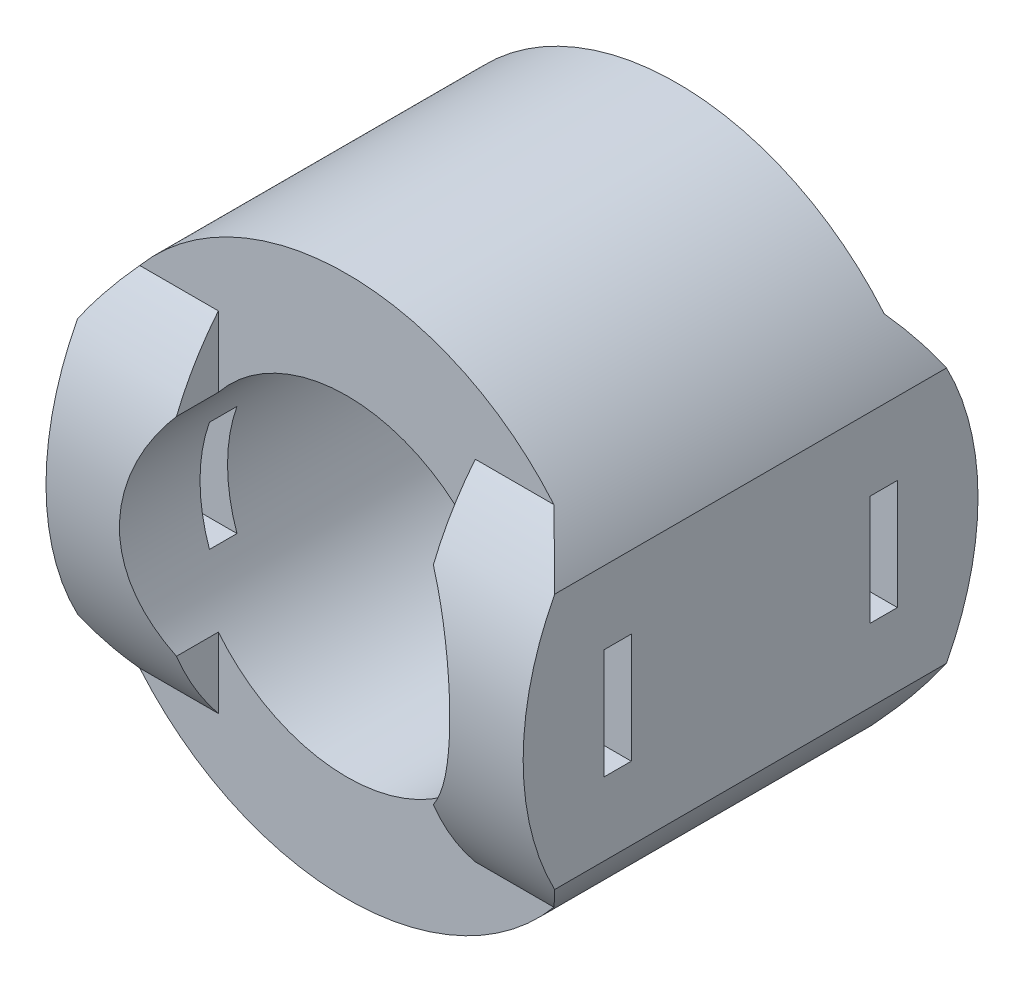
ISO-10303-21;
HEADER;
FILE_DESCRIPTION(('STEP AP214'),'2;1');
FILE_NAME('part.step','',(''),(''),'','','');
FILE_SCHEMA(('AUTOMOTIVE_DESIGN { 1 0 10303 214 1 1 1 1 }'));
ENDSEC;
DATA;
#1=APPLICATION_CONTEXT('core data for automotive mechanical design processes');
#2=APPLICATION_PROTOCOL_DEFINITION('international standard','automotive_design',2000,#1);
#3=PRODUCT_CONTEXT('',#1,'mechanical');
#4=PRODUCT('Part','Part','',(#3));
#5=PRODUCT_RELATED_PRODUCT_CATEGORY('part','',(#4));
#6=PRODUCT_DEFINITION_FORMATION('','',#4);
#7=PRODUCT_DEFINITION_CONTEXT('part definition',#1,'design');
#8=PRODUCT_DEFINITION('design','',#6,#7);
#9=PRODUCT_DEFINITION_SHAPE('','',#8);
#10=(LENGTH_UNIT() NAMED_UNIT(*) SI_UNIT(.MILLI.,.METRE.));
#11=(NAMED_UNIT(*) PLANE_ANGLE_UNIT() SI_UNIT($,.RADIAN.));
#12=(NAMED_UNIT(*) SI_UNIT($,.STERADIAN.) SOLID_ANGLE_UNIT());
#13=UNCERTAINTY_MEASURE_WITH_UNIT(LENGTH_MEASURE(1.E-05),#10,'distance_accuracy_value','');
#14=(GEOMETRIC_REPRESENTATION_CONTEXT(3) GLOBAL_UNCERTAINTY_ASSIGNED_CONTEXT((#13)) GLOBAL_UNIT_ASSIGNED_CONTEXT((#10,
#11,#12)) REPRESENTATION_CONTEXT('',''));
#15=CARTESIAN_POINT('',(0.,0.,0.));
#16=DIRECTION('',(0.,0.,1.));
#17=DIRECTION('',(1.,0.,0.));
#18=AXIS2_PLACEMENT_3D('',#15,#16,#17);
#19=CARTESIAN_POINT('',(-64.6007459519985,0.,23.2163735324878));
#20=DIRECTION('',(1.,0.,0.));
#21=DIRECTION('',(0.,1.,0.));
#22=AXIS2_PLACEMENT_3D('',#19,#20,#21);
#23=CYLINDRICAL_SURFACE('',#22,30.);
#24=DIRECTION('',(1.,0.,0.));
#25=VECTOR('',#24,1.);
#26=CARTESIAN_POINT('',(-64.6007459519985,19.,0.));
#27=LINE('',#26,#25);
#28=CARTESIAN_POINT('',(14.,19.,0.));
#29=VERTEX_POINT('',#28);
#30=CARTESIAN_POINT('',(22.5665681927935,19.,0.));
#31=VERTEX_POINT('',#30);
#32=EDGE_CURVE('E668',#29,#31,#27,.T.);
#33=ORIENTED_EDGE('',*,*,#32,.T.);
#34=CARTESIAN_POINT('',(22.5665681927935,19.,0.));
#35=CARTESIAN_POINT('',(22.8849291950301,18.6218676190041,-0.309454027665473));
#36=CARTESIAN_POINT('',(23.196413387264,18.2326318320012,-0.612577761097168));
#37=CARTESIAN_POINT('',(23.8030932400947,17.4331273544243,-1.20354690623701));
#38=CARTESIAN_POINT('',(24.0983358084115,17.0229266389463,-1.4914362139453));
#39=CARTESIAN_POINT('',(24.6719882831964,16.1803185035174,-2.05125580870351));
#40=CARTESIAN_POINT('',(24.9503967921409,15.7479092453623,-2.32318477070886));
#41=CARTESIAN_POINT('',(25.48935027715,14.8598008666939,-2.84996012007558));
#42=CARTESIAN_POINT('',(25.7498378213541,14.4040343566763,-3.104751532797));
#43=CARTESIAN_POINT('',(26.,13.9373598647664,-3.34958212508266));
#44=B_SPLINE_CURVE_WITH_KNOTS('',3,(#34,#35,#36,#37,#38,#39,#40,#41,#42,#43),.UNSPECIFIED.,.F.,
.F.,(4,2,2,2,4),(0.,1.74948589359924,3.49362061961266,5.23789994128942,6.98753124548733),.UNSPECIFIED.);
#45=CARTESIAN_POINT('',(26.,13.9373598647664,-3.34958212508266));
#46=VERTEX_POINT('',#45);
#47=EDGE_CURVE('E396',#31,#46,#44,.T.);
#48=ORIENTED_EDGE('',*,*,#47,.T.);
#49=CARTESIAN_POINT('',(26.,0.,23.2163735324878));
#50=DIRECTION('',(1.,0.,0.));
#51=DIRECTION('',(0.,1.,0.));
#52=AXIS2_PLACEMENT_3D('',#49,#50,#51);
#53=CIRCLE('',#52,30.);
#54=CARTESIAN_POINT('',(26.,-13.9373598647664,-3.34958212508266));
#55=VERTEX_POINT('',#54);
#56=EDGE_CURVE('E671',#55,#46,#53,.T.);
#57=ORIENTED_EDGE('',*,*,#56,.F.);
#58=CARTESIAN_POINT('',(26.,-13.9373598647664,-3.34958212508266));
#59=CARTESIAN_POINT('',(25.7498378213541,-14.4040343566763,-3.104751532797));
#60=CARTESIAN_POINT('',(25.48935027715,-14.859800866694,-2.84996012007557));
#61=CARTESIAN_POINT('',(24.9503967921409,-15.7479092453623,-2.32318477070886));
#62=CARTESIAN_POINT('',(24.6719882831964,-16.1803185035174,-2.05125580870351));
#63=CARTESIAN_POINT('',(24.0983358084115,-17.0229266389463,-1.49143621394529));
#64=CARTESIAN_POINT('',(23.8030932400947,-17.4331273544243,-1.203546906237));
#65=CARTESIAN_POINT('',(23.196413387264,-18.2326318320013,-0.612577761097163));
#66=CARTESIAN_POINT('',(22.8849291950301,-18.6218676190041,-0.30945402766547));
#67=CARTESIAN_POINT('',(22.5665681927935,-19.,0.));
#68=B_SPLINE_CURVE_WITH_KNOTS('',3,(#58,#59,#60,#61,#62,#63,#64,#65,#66,#67),.UNSPECIFIED.,.F.,
.F.,(4,2,2,2,4),(0.,1.74963130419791,3.49391062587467,5.23804535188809,6.98753124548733),.UNSPECIFIED.);
#69=CARTESIAN_POINT('',(22.5665681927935,-19.,0.));
#70=VERTEX_POINT('',#69);
#71=EDGE_CURVE('E406',#55,#70,#68,.T.);
#72=ORIENTED_EDGE('',*,*,#71,.T.);
#73=DIRECTION('',(1.,0.,0.));
#74=VECTOR('',#73,1.);
#75=CARTESIAN_POINT('',(-64.6007459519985,-19.,0.));
#76=LINE('',#75,#74);
#77=CARTESIAN_POINT('',(14.,-19.,0.));
#78=VERTEX_POINT('',#77);
#79=EDGE_CURVE('E658',#78,#70,#76,.T.);
#80=ORIENTED_EDGE('',*,*,#79,.F.);
#81=CARTESIAN_POINT('',(14.,0.,23.2163735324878));
#82=DIRECTION('',(1.,0.,0.));
#83=DIRECTION('',(0.,1.,0.));
#84=AXIS2_PLACEMENT_3D('',#81,#82,#83);
#85=CIRCLE('',#84,30.);
#86=CARTESIAN_POINT('',(14.,-11.3137084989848,-4.56851444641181));
#87=VERTEX_POINT('',#86);
#88=EDGE_CURVE('E441',#87,#78,#85,.F.);
#89=ORIENTED_EDGE('',*,*,#88,.F.);
#90=CARTESIAN_POINT('',(18.,0.,-6.7836264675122));
#91=CARTESIAN_POINT('',(17.999996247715,-0.460612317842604,-6.78362297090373));
#92=CARTESIAN_POINT('',(17.9822921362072,-0.92134110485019,-6.77299139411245));
#93=CARTESIAN_POINT('',(17.911700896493,-1.83932264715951,-6.73071735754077));
#94=CARTESIAN_POINT('',(17.8587931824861,-2.29657321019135,-6.69906260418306));
#95=CARTESIAN_POINT('',(17.7183641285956,-3.20487010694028,-6.61544233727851));
#96=CARTESIAN_POINT('',(17.6307675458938,-3.65590073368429,-6.56343267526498));
#97=CARTESIAN_POINT('',(17.4221309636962,-4.54740994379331,-6.440388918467));
#98=CARTESIAN_POINT('',(17.3010955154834,-4.98788995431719,-6.36935741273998));
#99=CARTESIAN_POINT('',(17.0277165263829,-5.85335853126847,-6.2103292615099));
#100=CARTESIAN_POINT('',(16.8755318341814,-6.27841329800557,-6.12241882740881));
#101=CARTESIAN_POINT('',(16.5410982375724,-7.11295835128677,-5.93133823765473));
#102=CARTESIAN_POINT('',(16.358848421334,-7.5224481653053,-5.82816761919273));
#103=CARTESIAN_POINT('',(15.9660494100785,-8.32371793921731,-5.6087580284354));
#104=CARTESIAN_POINT('',(15.7555121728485,-8.71550528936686,-5.49252458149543));
#105=CARTESIAN_POINT('',(15.3077111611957,-9.47999294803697,-5.24923179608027));
#106=CARTESIAN_POINT('',(15.0704446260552,-9.85269127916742,-5.12217133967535));
#107=CARTESIAN_POINT('',(14.5516473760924,-10.6053828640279,-4.84958556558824));
#108=CARTESIAN_POINT('',(14.2681197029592,-10.9837574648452,-4.70339119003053));
#109=CARTESIAN_POINT('',(13.6736671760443,-11.7155056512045,-4.40432855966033));
#110=CARTESIAN_POINT('',(13.3627411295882,-12.0688781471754,-4.25146001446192));
#111=CARTESIAN_POINT('',(12.7146537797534,-12.7498541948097,-3.94207345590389));
#112=CARTESIAN_POINT('',(12.3774612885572,-13.0774261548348,-3.78555126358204));
#113=CARTESIAN_POINT('',(11.6785292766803,-13.7052047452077,-3.47239622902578));
#114=CARTESIAN_POINT('',(11.3167884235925,-14.005409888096,-3.31576338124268));
#115=CARTESIAN_POINT('',(10.5241107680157,-14.6123897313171,-2.9868963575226));
#116=CARTESIAN_POINT('',(10.090131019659,-14.9154464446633,-2.81510754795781));
#117=CARTESIAN_POINT('',(9.1943880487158,-15.4836871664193,-2.48117665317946));
#118=CARTESIAN_POINT('',(8.73262025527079,-15.7488649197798,-2.31903616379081));
#119=CARTESIAN_POINT('',(7.7838746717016,-16.2387169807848,-2.01035427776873));
#120=CARTESIAN_POINT('',(7.29693088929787,-16.4634441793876,-1.86379261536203));
#121=CARTESIAN_POINT('',(6.29982343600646,-16.8701465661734,-1.59205348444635));
#122=CARTESIAN_POINT('',(5.78966851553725,-17.0521377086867,-1.46686804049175));
#123=CARTESIAN_POINT('',(4.87525343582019,-17.332112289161,-1.27075778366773));
#124=CARTESIAN_POINT('',(4.47517706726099,-17.4397693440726,-1.194030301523));
#125=CARTESIAN_POINT('',(3.66563898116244,-17.6276958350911,-1.05867103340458));
#126=CARTESIAN_POINT('',(3.25617872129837,-17.7079694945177,-1.00003645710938));
#127=CARTESIAN_POINT('',(2.43075519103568,-17.8400091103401,-0.902930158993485));
#128=CARTESIAN_POINT('',(2.01479930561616,-17.891805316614,-0.864437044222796));
#129=CARTESIAN_POINT('',(1.1788348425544,-17.9662579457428,-0.808941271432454));
#130=CARTESIAN_POINT('',(0.75882619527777,-17.988913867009,-0.791938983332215));
#131=CARTESIAN_POINT('',(-0.082891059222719,-18.0047399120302,-0.780072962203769));
#132=CARTESIAN_POINT('',(-0.504601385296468,-17.9978518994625,-0.785252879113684));
#133=CARTESIAN_POINT('',(-1.34564358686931,-17.9545693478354,-0.817647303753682));
#134=CARTESIAN_POINT('',(-1.76497545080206,-17.9181746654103,-0.844861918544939));
#135=CARTESIAN_POINT('',(-2.59844448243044,-17.8164103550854,-0.920310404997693));
#136=CARTESIAN_POINT('',(-3.01257812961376,-17.7510220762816,-0.968557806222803));
#137=CARTESIAN_POINT('',(-3.83266134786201,-17.5921908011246,-1.0843353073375));
#138=CARTESIAN_POINT('',(-4.23861072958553,-17.4987471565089,-1.15186585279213));
#139=CARTESIAN_POINT('',(-5.03472685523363,-17.2863824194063,-1.30295978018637));
#140=CARTESIAN_POINT('',(-5.42503163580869,-17.167816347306,-1.38629820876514));
#141=CARTESIAN_POINT('',(-6.19389910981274,-16.9056403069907,-1.56718308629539));
#142=CARTESIAN_POINT('',(-6.57245703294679,-16.7620203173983,-1.66473521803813));
#143=CARTESIAN_POINT('',(-7.31633017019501,-16.4509529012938,-1.87149219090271));
#144=CARTESIAN_POINT('',(-7.68164554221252,-16.2835057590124,-1.98069689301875));
#145=CARTESIAN_POINT('',(-8.39803374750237,-15.9258704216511,-2.20825184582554));
#146=CARTESIAN_POINT('',(-8.74910483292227,-15.7356794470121,-2.32660321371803));
#147=CARTESIAN_POINT('',(-9.49622432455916,-15.2983793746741,-2.5912959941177));
#148=CARTESIAN_POINT('',(-9.88940412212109,-15.0471327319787,-2.73891320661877));
#149=CARTESIAN_POINT('',(-10.653718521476,-14.5160219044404,-3.03964011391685));
#150=CARTESIAN_POINT('',(-11.0248512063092,-14.2361552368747,-3.19275028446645));
#151=CARTESIAN_POINT('',(-11.7442244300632,-13.6487724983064,-3.50105726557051));
#152=CARTESIAN_POINT('',(-12.0924448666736,-13.3412326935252,-3.65625576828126));
#153=CARTESIAN_POINT('',(-12.7644150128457,-12.6998217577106,-3.96526141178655));
#154=CARTESIAN_POINT('',(-13.0881633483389,-12.3659491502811,-4.1190684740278));
#155=CARTESIAN_POINT('',(-13.7532165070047,-11.6245602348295,-4.44325905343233));
#156=CARTESIAN_POINT('',(-14.0906641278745,-11.2132695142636,-4.61295965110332));
#157=CARTESIAN_POINT('',(-14.7296330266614,-10.3596410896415,-4.94187697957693));
#158=CARTESIAN_POINT('',(-15.0311505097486,-9.91730011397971,-5.10109260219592));
#159=CARTESIAN_POINT('',(-15.5954409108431,-9.00390222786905,-5.40461923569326));
#160=CARTESIAN_POINT('',(-15.8582279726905,-8.5328558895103,-5.54893568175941));
#161=CARTESIAN_POINT('',(-16.3422308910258,-7.56467339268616,-5.8185728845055));
#162=CARTESIAN_POINT('',(-16.5634519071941,-7.06754048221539,-5.94389599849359));
#163=CARTESIAN_POINT('',(-16.9488126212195,-6.08271837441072,-6.16455410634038));
#164=CARTESIAN_POINT('',(-17.1156694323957,-5.59640555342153,-6.26128046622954));
#165=CARTESIAN_POINT('',(-17.4079378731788,-4.60754165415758,-6.43193513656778));
#166=CARTESIAN_POINT('',(-17.5333506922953,-4.10499104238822,-6.50586410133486));
#167=CARTESIAN_POINT('',(-17.7406334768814,-3.0884810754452,-6.62861102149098));
#168=CARTESIAN_POINT('',(-17.8225468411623,-2.57453362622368,-6.67745400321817));
#169=CARTESIAN_POINT('',(-17.9415868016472,-1.53967891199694,-6.74857652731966));
#170=CARTESIAN_POINT('',(-17.9787196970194,-1.01877263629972,-6.77085980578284));
#171=CARTESIAN_POINT('',(-18.005591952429,-0.0462685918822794,-6.7869812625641));
#172=CARTESIAN_POINT('',(-18.0010874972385,0.405125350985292,-6.78427430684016));
#173=CARTESIAN_POINT('',(-17.9582383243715,1.30568921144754,-6.75858294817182));
#174=CARTESIAN_POINT('',(-17.919897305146,1.75485936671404,-6.73560076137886));
#175=CARTESIAN_POINT('',(-17.8098981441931,2.64760780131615,-6.66991988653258));
#176=CARTESIAN_POINT('',(-17.7382410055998,3.09118624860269,-6.627221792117));
#177=CARTESIAN_POINT('',(-17.5625344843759,3.9696387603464,-6.52312228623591));
#178=CARTESIAN_POINT('',(-17.4584842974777,4.40451260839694,-6.46172041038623));
#179=CARTESIAN_POINT('',(-17.222166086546,5.25222627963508,-6.32332972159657));
#180=CARTESIAN_POINT('',(-17.0906498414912,5.66534485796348,-6.24675852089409));
#181=CARTESIAN_POINT('',(-16.7993361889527,6.4783303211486,-6.07873769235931));
#182=CARTESIAN_POINT('',(-16.6395396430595,6.87819760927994,-5.98728851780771));
#183=CARTESIAN_POINT('',(-16.293106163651,7.66280786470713,-5.79129630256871));
#184=CARTESIAN_POINT('',(-16.1064677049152,8.04754997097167,-5.68675251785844));
#185=CARTESIAN_POINT('',(-15.7078098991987,8.80035021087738,-5.46650791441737));
#186=CARTESIAN_POINT('',(-15.495787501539,9.16840633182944,-5.35080575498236));
#187=CARTESIAN_POINT('',(-15.0245479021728,9.92376621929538,-5.09781922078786));
#188=CARTESIAN_POINT('',(-14.7627165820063,10.3091072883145,-4.95954102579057));
#189=CARTESIAN_POINT('',(-14.2116479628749,11.0564303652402,-4.67475927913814));
#190=CARTESIAN_POINT('',(-13.9224090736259,11.4184110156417,-4.5282552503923));
#191=CARTESIAN_POINT('',(-13.3177935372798,12.1181852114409,-4.22983603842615));
#192=CARTESIAN_POINT('',(-13.0023893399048,12.4559525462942,-4.07791525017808));
#193=CARTESIAN_POINT('',(-12.3471137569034,13.1057902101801,-3.77190677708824));
#194=CARTESIAN_POINT('',(-12.0072413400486,13.417859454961,-3.6178190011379));
#195=CARTESIAN_POINT('',(-11.2583754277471,14.0542116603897,-3.2906676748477));
#196=CARTESIAN_POINT('',(-10.8461485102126,14.3747782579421,-3.11775060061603));
#197=CARTESIAN_POINT('',(-9.9936051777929,14.9800282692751,-2.77822612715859));
#198=CARTESIAN_POINT('',(-9.55328425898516,15.2647059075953,-2.61161974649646));
#199=CARTESIAN_POINT('',(-8.64653172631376,15.7959878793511,-2.29015667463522));
#200=CARTESIAN_POINT('',(-8.1801219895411,16.0426234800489,-2.1352903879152));
#201=CARTESIAN_POINT('',(-7.46248889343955,16.3823476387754,-1.9160133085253));
#202=CARTESIAN_POINT('',(-7.22029484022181,16.4905433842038,-1.84509648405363));
#203=CARTESIAN_POINT('',(-6.73007458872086,16.6966106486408,-1.70828259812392));
#204=CARTESIAN_POINT('',(-6.48204688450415,16.7944794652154,-1.64238685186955));
#205=CARTESIAN_POINT('',(-5.83822191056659,17.0320478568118,-1.48059343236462));
#206=CARTESIAN_POINT('',(-5.4384486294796,17.1639648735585,-1.38889325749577));
#207=CARTESIAN_POINT('',(-4.62745216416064,17.4001442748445,-1.2224455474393));
#208=CARTESIAN_POINT('',(-4.21623150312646,17.5044127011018,-1.14769430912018));
#209=CARTESIAN_POINT('',(-3.384938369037,17.6839691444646,-1.01768392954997));
#210=CARTESIAN_POINT('',(-2.96487654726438,17.7592901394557,-0.962402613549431));
#211=CARTESIAN_POINT('',(-2.1182014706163,17.8800465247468,-0.873242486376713));
#212=CARTESIAN_POINT('',(-1.69158817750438,17.9254817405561,-0.839363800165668));
#213=CARTESIAN_POINT('',(-0.833358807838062,17.9858625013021,-0.794253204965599));
#214=CARTESIAN_POINT('',(-0.401729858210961,18.0006911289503,-0.783108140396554));
#215=CARTESIAN_POINT('',(0.461447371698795,17.9992593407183,-0.784181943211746));
#216=CARTESIAN_POINT('',(0.892995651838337,17.9829988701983,-0.796400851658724));
#217=CARTESIAN_POINT('',(1.75274654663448,17.9196479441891,-0.843712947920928));
#218=CARTESIAN_POINT('',(2.1809474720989,17.8725428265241,-0.878817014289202));
#219=CARTESIAN_POINT('',(3.03059560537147,17.7482350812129,-0.970525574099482));
#220=CARTESIAN_POINT('',(3.45204278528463,17.6710323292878,-1.02713015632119));
#221=CARTESIAN_POINT('',(4.26517619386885,17.4920869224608,-1.15653029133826));
#222=CARTESIAN_POINT('',(4.65731400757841,17.3917174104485,-1.22840651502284));
#223=CARTESIAN_POINT('',(5.43117710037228,17.1658048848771,-1.38757375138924));
#224=CARTESIAN_POINT('',(5.81289896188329,17.0402537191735,-1.47486975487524));
#225=CARTESIAN_POINT('',(6.56429598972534,16.7651459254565,-1.66248460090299));
#226=CARTESIAN_POINT('',(6.93397032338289,16.6155876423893,-1.76280434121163));
#227=CARTESIAN_POINT('',(7.66007096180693,16.2935897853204,-1.97402145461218));
#228=CARTESIAN_POINT('',(8.01649668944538,16.1211492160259,-2.08491928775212));
#229=CARTESIAN_POINT('',(8.76888223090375,15.7262169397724,-2.33256834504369));
#230=CARTESIAN_POINT('',(9.16249924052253,15.500106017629,-2.47067352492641));
#231=CARTESIAN_POINT('',(9.92960062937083,15.0202433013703,-2.75418560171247));
#232=CARTESIAN_POINT('',(10.3030880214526,14.7664956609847,-2.89959139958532));
#233=CARTESIAN_POINT('',(11.0292649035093,14.2323098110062,-3.19450497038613));
#234=CARTESIAN_POINT('',(11.3819370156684,13.9518497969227,-3.34401602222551));
#235=CARTESIAN_POINT('',(12.0650935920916,13.3654845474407,-3.64386255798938));
#236=CARTESIAN_POINT('',(12.39557664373,13.0595776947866,-3.79419809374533));
#237=CARTESIAN_POINT('',(13.085340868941,12.3712747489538,-4.11709799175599));
#238=CARTESIAN_POINT('',(13.4404990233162,11.9845493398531,-4.28927899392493));
#239=CARTESIAN_POINT('',(14.1171468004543,11.1795642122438,-4.62617936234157));
#240=CARTESIAN_POINT('',(14.438632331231,10.7613006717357,-4.79089782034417));
#241=CARTESIAN_POINT('',(15.0456476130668,9.89486635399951,-5.10860843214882));
#242=CARTESIAN_POINT('',(15.3311595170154,9.44668089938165,-5.26159475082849));
#243=CARTESIAN_POINT('',(15.8633022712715,8.5228920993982,-5.55157023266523));
#244=CARTESIAN_POINT('',(16.1099379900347,8.04729219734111,-5.68856139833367));
#245=CARTESIAN_POINT('',(16.5545817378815,7.08642582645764,-5.93875368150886));
#246=CARTESIAN_POINT('',(16.7538437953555,6.60189697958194,-6.05255310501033));
#247=CARTESIAN_POINT('',(17.1105364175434,5.6130018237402,-6.25817816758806));
#248=CARTESIAN_POINT('',(17.2679599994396,5.10863221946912,-6.35000013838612));
#249=CARTESIAN_POINT('',(17.5380508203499,4.08601914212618,-6.50855392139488));
#250=CARTESIAN_POINT('',(17.650865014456,3.5678273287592,-6.57536807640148));
#251=CARTESIAN_POINT('',(17.8304675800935,2.52110015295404,-6.68212663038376));
#252=CARTESIAN_POINT('',(17.8972942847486,1.99257378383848,-6.72209340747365));
#253=CARTESIAN_POINT('',(17.9603501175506,1.21874406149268,-6.75985019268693));
#254=CARTESIAN_POINT('',(17.9752109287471,0.97533860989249,-6.7687586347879));
#255=CARTESIAN_POINT('',(17.9950370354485,0.487966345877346,-6.78064780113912));
#256=CARTESIAN_POINT('',(18.0000019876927,0.243999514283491,-6.78362831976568));
#257=CARTESIAN_POINT('',(18.,0.,-6.7836264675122));
#258=B_SPLINE_CURVE_WITH_KNOTS('',3,(#90,#91,#92,#93,#94,#95,#96,#97,#98,#99,#100,#101,#102,
#103,#104,#105,#106,#107,#108,#109,#110,#111,#112,#113,#114,#115,#116,#117,#118,#119,#120,#121,
#122,#123,#124,#125,#126,#127,#128,#129,#130,#131,#132,#133,#134,#135,#136,#137,#138,#139,#140,
#141,#142,#143,#144,#145,#146,#147,#148,#149,#150,#151,#152,#153,#154,#155,#156,#157,#158,#159,
#160,#161,#162,#163,#164,#165,#166,#167,#168,#169,#170,#171,#172,#173,#174,#175,#176,#177,#178,
#179,#180,#181,#182,#183,#184,#185,#186,#187,#188,#189,#190,#191,#192,#193,#194,#195,#196,#197,
#198,#199,#200,#201,#202,#203,#204,#205,#206,#207,#208,#209,#210,#211,#212,#213,#214,#215,#216,
#217,#218,#219,#220,#221,#222,#223,#224,#225,#226,#227,#228,#229,#230,#231,#232,#233,#234,#235,
#236,#237,#238,#239,#240,#241,#242,#243,#244,#245,#246,#247,#248,#249,#250,#251,#252,#253,#254,
#255,#256,#257),.UNSPECIFIED.,.T.,.F.,(4,2,2,2,2,2,2,2,2,2,2,2,2,2,2,2,2,2,2,2,2,2,2,2,2,2,2,2,
2,2,2,2,2,2,2,2,2,2,2,2,2,2,2,2,2,2,2,2,2,2,2,2,2,2,2,2,2,2,2,2,2,2,2,2,2,2,2,2,2,2,2,2,2,2,2,2,
2,2,2,2,2,2,2,4),(0.,1.38157980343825,2.76396821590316,4.14937170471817,5.5345867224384,
6.91290623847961,8.29126756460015,9.66904804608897,11.046970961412,12.5301827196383,
14.0134590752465,15.4985242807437,16.983670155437,18.6511407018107,20.3188862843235,
21.9844351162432,23.6493611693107,24.9121602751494,26.1747645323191,27.4360249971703,
28.697307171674,29.9610724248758,31.2248438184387,32.4894293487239,33.7540441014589,
35.001855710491,36.2501675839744,37.4984645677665,38.7469142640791,40.213651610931,
41.6805163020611,43.1486512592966,44.6168685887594,46.2900254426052,47.9633588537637,
49.6360796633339,51.308592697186,52.8757937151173,54.4429497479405,56.0085392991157,
57.5739085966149,58.9264936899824,60.2789309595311,61.6313275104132,62.9837576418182,
64.303135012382,65.6224721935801,66.9418843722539,68.261455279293,69.7178822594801,
71.1743937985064,72.6324588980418,74.0905854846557,75.7389056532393,77.3874907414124,
79.0347135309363,79.8581934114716,80.6818882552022,81.973056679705,83.2639427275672,
84.5533537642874,85.8427723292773,87.1371074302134,88.4314448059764,89.7263978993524,
91.0213563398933,92.253454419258,93.4859520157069,94.7185346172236,95.9511708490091,
97.3732474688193,98.7951106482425,100.218144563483,101.641268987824,103.297019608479,
104.952971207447,106.609741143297,108.266303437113,109.872324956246,111.478614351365,
113.079567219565,114.679183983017,115.411020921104,116.1428832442),.UNSPECIFIED.);
#259=CARTESIAN_POINT('',(14.,11.3137084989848,-4.56851444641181));
#260=VERTEX_POINT('',#259);
#261=EDGE_CURVE('E434',#260,#87,#258,.T.);
#262=ORIENTED_EDGE('',*,*,#261,.F.);
#263=CARTESIAN_POINT('',(14.,0.,23.2163735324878));
#264=DIRECTION('',(1.,0.,0.));
#265=DIRECTION('',(0.,1.,0.));
#266=AXIS2_PLACEMENT_3D('',#263,#264,#265);
#267=CIRCLE('',#266,30.);
#268=EDGE_CURVE('E440',#29,#260,#267,.F.);
#269=ORIENTED_EDGE('',*,*,#268,.F.);
#270=EDGE_LOOP('',(#33,#48,#57,#72,#80,#89,#262,#269));
#271=FACE_BOUND('',#270,.T.);
#272=ADVANCED_FACE('F31',(#271),#23,.T.);
#273=CARTESIAN_POINT('',(-64.6007459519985,0.,12.7836264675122));
#274=DIRECTION('',(1.,0.,0.));
#275=DIRECTION('',(0.,1.,0.));
#276=AXIS2_PLACEMENT_3D('',#273,#274,#275);
#277=CYLINDRICAL_SURFACE('',#276,30.);
#278=DIRECTION('',(1.,0.,0.));
#279=VECTOR('',#278,1.);
#280=CARTESIAN_POINT('',(-64.6007459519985,-19.,36.));
#281=LINE('',#280,#279);
#282=CARTESIAN_POINT('',(14.,-19.,36.));
#283=VERTEX_POINT('',#282);
#284=CARTESIAN_POINT('',(22.5665681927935,-19.,36.));
#285=VERTEX_POINT('',#284);
#286=EDGE_CURVE('E513',#283,#285,#281,.T.);
#287=ORIENTED_EDGE('',*,*,#286,.T.);
#288=CARTESIAN_POINT('',(22.5665681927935,-19.,36.));
#289=CARTESIAN_POINT('',(22.8849291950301,-18.6218676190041,36.3094540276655));
#290=CARTESIAN_POINT('',(23.196413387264,-18.2326318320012,36.6125777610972));
#291=CARTESIAN_POINT('',(23.8030932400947,-17.4331273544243,37.203546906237));
#292=CARTESIAN_POINT('',(24.0983358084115,-17.0229266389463,37.4914362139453));
#293=CARTESIAN_POINT('',(24.6719882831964,-16.1803185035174,38.0512558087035));
#294=CARTESIAN_POINT('',(24.9503967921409,-15.7479092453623,38.3231847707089));
#295=CARTESIAN_POINT('',(25.48935027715,-14.859800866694,38.8499601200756));
#296=CARTESIAN_POINT('',(25.7498378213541,-14.4040343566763,39.104751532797));
#297=CARTESIAN_POINT('',(26.,-13.9373598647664,39.3495821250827));
#298=B_SPLINE_CURVE_WITH_KNOTS('',3,(#288,#289,#290,#291,#292,#293,#294,#295,#296,#297),
.UNSPECIFIED.,.F.,.F.,(4,2,2,2,4),(0.,1.74948589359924,3.49362061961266,5.23789994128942,
6.98753124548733),.UNSPECIFIED.);
#299=CARTESIAN_POINT('',(26.,-13.9373598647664,39.3495821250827));
#300=VERTEX_POINT('',#299);
#301=EDGE_CURVE('E401',#285,#300,#298,.T.);
#302=ORIENTED_EDGE('',*,*,#301,.T.);
#303=CARTESIAN_POINT('',(26.,0.,12.7836264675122));
#304=DIRECTION('',(1.,0.,0.));
#305=DIRECTION('',(0.,1.,0.));
#306=AXIS2_PLACEMENT_3D('',#303,#304,#305);
#307=CIRCLE('',#306,30.);
#308=CARTESIAN_POINT('',(26.,13.9373598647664,39.3495821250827));
#309=VERTEX_POINT('',#308);
#310=EDGE_CURVE('E519',#309,#300,#307,.T.);
#311=ORIENTED_EDGE('',*,*,#310,.F.);
#312=CARTESIAN_POINT('',(26.,13.9373598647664,39.3495821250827));
#313=CARTESIAN_POINT('',(25.7498378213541,14.4040343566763,39.104751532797));
#314=CARTESIAN_POINT('',(25.48935027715,14.8598008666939,38.8499601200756));
#315=CARTESIAN_POINT('',(24.9503967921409,15.7479092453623,38.3231847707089));
#316=CARTESIAN_POINT('',(24.6719882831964,16.1803185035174,38.0512558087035));
#317=CARTESIAN_POINT('',(24.0983358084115,17.0229266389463,37.4914362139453));
#318=CARTESIAN_POINT('',(23.8030932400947,17.4331273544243,37.203546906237));
#319=CARTESIAN_POINT('',(23.196413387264,18.2326318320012,36.6125777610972));
#320=CARTESIAN_POINT('',(22.8849291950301,18.6218676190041,36.3094540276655));
#321=CARTESIAN_POINT('',(22.5665681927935,19.,36.));
#322=B_SPLINE_CURVE_WITH_KNOTS('',3,(#312,#313,#314,#315,#316,#317,#318,#319,#320,#321),
.UNSPECIFIED.,.F.,.F.,(4,2,2,2,4),(0.,1.74963130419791,3.49391062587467,5.23804535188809,
6.98753124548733),.UNSPECIFIED.);
#323=CARTESIAN_POINT('',(22.5665681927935,19.,36.));
#324=VERTEX_POINT('',#323);
#325=EDGE_CURVE('E360',#309,#324,#322,.T.);
#326=ORIENTED_EDGE('',*,*,#325,.T.);
#327=DIRECTION('',(1.,0.,0.));
#328=VECTOR('',#327,1.);
#329=CARTESIAN_POINT('',(-64.6007459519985,19.,36.));
#330=LINE('',#329,#328);
#331=CARTESIAN_POINT('',(14.,19.,36.));
#332=VERTEX_POINT('',#331);
#333=EDGE_CURVE('E512',#332,#324,#330,.T.);
#334=ORIENTED_EDGE('',*,*,#333,.F.);
#335=CARTESIAN_POINT('',(14.,0.,12.7836264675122));
#336=DIRECTION('',(-1.,0.,0.));
#337=DIRECTION('',(0.,0.,1.));
#338=AXIS2_PLACEMENT_3D('',#335,#336,#337);
#339=CIRCLE('',#338,30.);
#340=CARTESIAN_POINT('',(14.,11.3137084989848,40.5685144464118));
#341=VERTEX_POINT('',#340);
#342=EDGE_CURVE('E467',#332,#341,#339,.F.);
#343=ORIENTED_EDGE('',*,*,#342,.T.);
#344=CARTESIAN_POINT('',(-18.,0.,42.7836264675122));
#345=CARTESIAN_POINT('',(-17.999996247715,0.460612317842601,42.7836229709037));
#346=CARTESIAN_POINT('',(-17.9822921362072,0.921341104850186,42.7729913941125));
#347=CARTESIAN_POINT('',(-17.911700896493,1.83932264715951,42.7307173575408));
#348=CARTESIAN_POINT('',(-17.8587931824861,2.29657321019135,42.6990626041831));
#349=CARTESIAN_POINT('',(-17.7183641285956,3.20487010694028,42.6154423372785));
#350=CARTESIAN_POINT('',(-17.6307675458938,3.65590073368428,42.563432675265));
#351=CARTESIAN_POINT('',(-17.4221309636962,4.54740994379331,42.440388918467));
#352=CARTESIAN_POINT('',(-17.3010955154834,4.98788995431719,42.36935741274));
#353=CARTESIAN_POINT('',(-17.0277165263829,5.85335853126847,42.2103292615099));
#354=CARTESIAN_POINT('',(-16.8755318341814,6.27841329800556,42.1224188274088));
#355=CARTESIAN_POINT('',(-16.5410982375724,7.11295835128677,41.9313382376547));
#356=CARTESIAN_POINT('',(-16.358848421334,7.5224481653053,41.8281676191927));
#357=CARTESIAN_POINT('',(-15.9660494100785,8.32371793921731,41.6087580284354));
#358=CARTESIAN_POINT('',(-15.7555121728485,8.71550528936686,41.4925245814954));
#359=CARTESIAN_POINT('',(-15.3077111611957,9.47999294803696,41.2492317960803));
#360=CARTESIAN_POINT('',(-15.0704446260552,9.85269127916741,41.1221713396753));
#361=CARTESIAN_POINT('',(-14.5516473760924,10.6053828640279,40.8495855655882));
#362=CARTESIAN_POINT('',(-14.2681197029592,10.9837574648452,40.7033911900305));
#363=CARTESIAN_POINT('',(-13.6736671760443,11.7155056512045,40.4043285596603));
#364=CARTESIAN_POINT('',(-13.3627411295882,12.0688781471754,40.2514600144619));
#365=CARTESIAN_POINT('',(-12.7146537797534,12.7498541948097,39.9420734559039));
#366=CARTESIAN_POINT('',(-12.3774612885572,13.0774261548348,39.7855512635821));
#367=CARTESIAN_POINT('',(-11.6785292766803,13.7052047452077,39.4723962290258));
#368=CARTESIAN_POINT('',(-11.3167884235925,14.005409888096,39.3157633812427));
#369=CARTESIAN_POINT('',(-10.5241107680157,14.6123897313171,38.9868963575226));
#370=CARTESIAN_POINT('',(-10.090131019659,14.9154464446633,38.8151075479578));
#371=CARTESIAN_POINT('',(-9.1943880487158,15.4836871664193,38.4811766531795));
#372=CARTESIAN_POINT('',(-8.73262025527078,15.7488649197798,38.3190361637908));
#373=CARTESIAN_POINT('',(-7.78387467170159,16.2387169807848,38.0103542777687));
#374=CARTESIAN_POINT('',(-7.29693088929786,16.4634441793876,37.863792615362));
#375=CARTESIAN_POINT('',(-6.29982343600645,16.8701465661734,37.5920534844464));
#376=CARTESIAN_POINT('',(-5.78966851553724,17.0521377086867,37.4668680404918));
#377=CARTESIAN_POINT('',(-4.87525343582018,17.332112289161,37.2707577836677));
#378=CARTESIAN_POINT('',(-4.47517706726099,17.4397693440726,37.194030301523));
#379=CARTESIAN_POINT('',(-3.66563898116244,17.6276958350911,37.0586710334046));
#380=CARTESIAN_POINT('',(-3.25617872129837,17.7079694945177,37.0000364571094));
#381=CARTESIAN_POINT('',(-2.43075519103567,17.8400091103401,36.9029301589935));
#382=CARTESIAN_POINT('',(-2.01479930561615,17.891805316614,36.8644370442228));
#383=CARTESIAN_POINT('',(-1.17883484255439,17.9662579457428,36.8089412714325));
#384=CARTESIAN_POINT('',(-0.758826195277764,17.988913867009,36.7919389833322));
#385=CARTESIAN_POINT('',(0.0828910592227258,18.0047399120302,36.7800729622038));
#386=CARTESIAN_POINT('',(0.504601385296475,17.9978518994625,36.7852528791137));
#387=CARTESIAN_POINT('',(1.34564358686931,17.9545693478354,36.8176473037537));
#388=CARTESIAN_POINT('',(1.76497545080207,17.9181746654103,36.844861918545));
#389=CARTESIAN_POINT('',(2.59844448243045,17.8164103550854,36.9203104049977));
#390=CARTESIAN_POINT('',(3.01257812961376,17.7510220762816,36.9685578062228));
#391=CARTESIAN_POINT('',(3.83266134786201,17.5921908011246,37.0843353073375));
#392=CARTESIAN_POINT('',(4.23861072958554,17.4987471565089,37.1518658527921));
#393=CARTESIAN_POINT('',(5.03472685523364,17.2863824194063,37.3029597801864));
#394=CARTESIAN_POINT('',(5.4250316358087,17.167816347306,37.3862982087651));
#395=CARTESIAN_POINT('',(6.19389910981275,16.9056403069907,37.5671830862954));
#396=CARTESIAN_POINT('',(6.5724570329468,16.7620203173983,37.6647352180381));
#397=CARTESIAN_POINT('',(7.31633017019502,16.4509529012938,37.8714921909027));
#398=CARTESIAN_POINT('',(7.68164554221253,16.2835057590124,37.9806968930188));
#399=CARTESIAN_POINT('',(8.39803374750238,15.9258704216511,38.2082518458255));
#400=CARTESIAN_POINT('',(8.74910483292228,15.7356794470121,38.326603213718));
#401=CARTESIAN_POINT('',(9.49622432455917,15.2983793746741,38.5912959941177));
#402=CARTESIAN_POINT('',(9.88940412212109,15.0471327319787,38.7389132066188));
#403=CARTESIAN_POINT('',(10.653718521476,14.5160219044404,39.0396401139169));
#404=CARTESIAN_POINT('',(11.0248512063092,14.2361552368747,39.1927502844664));
#405=CARTESIAN_POINT('',(11.7442244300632,13.6487724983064,39.5010572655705));
#406=CARTESIAN_POINT('',(12.0924448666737,13.3412326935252,39.6562557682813));
#407=CARTESIAN_POINT('',(12.7644150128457,12.6998217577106,39.9652614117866));
#408=CARTESIAN_POINT('',(13.088163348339,12.3659491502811,40.1190684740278));
#409=CARTESIAN_POINT('',(13.7532165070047,11.6245602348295,40.4432590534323));
#410=CARTESIAN_POINT('',(14.0906641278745,11.2132695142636,40.6129596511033));
#411=CARTESIAN_POINT('',(14.7296330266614,10.3596410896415,40.9418769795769));
#412=CARTESIAN_POINT('',(15.0311505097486,9.91730011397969,41.1010926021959));
#413=CARTESIAN_POINT('',(15.5954409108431,9.00390222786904,41.4046192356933));
#414=CARTESIAN_POINT('',(15.8582279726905,8.53285588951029,41.5489356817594));
#415=CARTESIAN_POINT('',(16.3422308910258,7.56467339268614,41.8185728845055));
#416=CARTESIAN_POINT('',(16.5634519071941,7.06754048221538,41.9438959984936));
#417=CARTESIAN_POINT('',(16.9488126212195,6.08271837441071,42.1645541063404));
#418=CARTESIAN_POINT('',(17.1156694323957,5.59640555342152,42.2612804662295));
#419=CARTESIAN_POINT('',(17.4079378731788,4.60754165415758,42.4319351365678));
#420=CARTESIAN_POINT('',(17.5333506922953,4.10499104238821,42.5058641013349));
#421=CARTESIAN_POINT('',(17.7406334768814,3.0884810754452,42.628611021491));
#422=CARTESIAN_POINT('',(17.8225468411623,2.57453362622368,42.6774540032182));
#423=CARTESIAN_POINT('',(17.9415868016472,1.53967891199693,42.7485765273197));
#424=CARTESIAN_POINT('',(17.9787196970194,1.01877263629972,42.7708598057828));
#425=CARTESIAN_POINT('',(18.005591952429,0.0462685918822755,42.7869812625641));
#426=CARTESIAN_POINT('',(18.0010874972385,-0.405125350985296,42.7842743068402));
#427=CARTESIAN_POINT('',(17.9582383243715,-1.30568921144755,42.7585829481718));
#428=CARTESIAN_POINT('',(17.919897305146,-1.75485936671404,42.7356007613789));
#429=CARTESIAN_POINT('',(17.8098981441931,-2.64760780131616,42.6699198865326));
#430=CARTESIAN_POINT('',(17.7382410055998,-3.09118624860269,42.627221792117));
#431=CARTESIAN_POINT('',(17.5625344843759,-3.9696387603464,42.5231222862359));
#432=CARTESIAN_POINT('',(17.4584842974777,-4.40451260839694,42.4617204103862));
#433=CARTESIAN_POINT('',(17.222166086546,-5.25222627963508,42.3233297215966));
#434=CARTESIAN_POINT('',(17.0906498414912,-5.66534485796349,42.2467585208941));
#435=CARTESIAN_POINT('',(16.7993361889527,-6.4783303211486,42.0787376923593));
#436=CARTESIAN_POINT('',(16.6395396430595,-6.87819760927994,41.9872885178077));
#437=CARTESIAN_POINT('',(16.293106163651,-7.66280786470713,41.7912963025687));
#438=CARTESIAN_POINT('',(16.1064677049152,-8.04754997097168,41.6867525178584));
#439=CARTESIAN_POINT('',(15.7078098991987,-8.80035021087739,41.4665079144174));
#440=CARTESIAN_POINT('',(15.495787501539,-9.16840633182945,41.3508057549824));
#441=CARTESIAN_POINT('',(15.0245479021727,-9.92376621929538,41.0978192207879));
#442=CARTESIAN_POINT('',(14.7627165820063,-10.3091072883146,40.9595410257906));
#443=CARTESIAN_POINT('',(14.2116479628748,-11.0564303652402,40.6747592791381));
#444=CARTESIAN_POINT('',(13.9224090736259,-11.4184110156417,40.5282552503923));
#445=CARTESIAN_POINT('',(13.3177935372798,-12.118185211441,40.2298360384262));
#446=CARTESIAN_POINT('',(13.0023893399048,-12.4559525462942,40.0779152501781));
#447=CARTESIAN_POINT('',(12.3471137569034,-13.1057902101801,39.7719067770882));
#448=CARTESIAN_POINT('',(12.0072413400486,-13.417859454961,39.6178190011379));
#449=CARTESIAN_POINT('',(11.2583754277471,-14.0542116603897,39.2906676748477));
#450=CARTESIAN_POINT('',(10.8461485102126,-14.3747782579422,39.117750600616));
#451=CARTESIAN_POINT('',(9.99360517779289,-14.9800282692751,38.7782261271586));
#452=CARTESIAN_POINT('',(9.55328425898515,-15.2647059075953,38.6116197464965));
#453=CARTESIAN_POINT('',(8.64653172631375,-15.7959878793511,38.2901566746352));
#454=CARTESIAN_POINT('',(8.18012198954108,-16.0426234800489,38.1352903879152));
#455=CARTESIAN_POINT('',(7.46248889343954,-16.3823476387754,37.9160133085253));
#456=CARTESIAN_POINT('',(7.2202948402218,-16.4905433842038,37.8450964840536));
#457=CARTESIAN_POINT('',(6.73007458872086,-16.6966106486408,37.7082825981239));
#458=CARTESIAN_POINT('',(6.48204688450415,-16.7944794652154,37.6423868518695));
#459=CARTESIAN_POINT('',(5.83822191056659,-17.0320478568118,37.4805934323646));
#460=CARTESIAN_POINT('',(5.4384486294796,-17.1639648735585,37.3888932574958));
#461=CARTESIAN_POINT('',(4.62745216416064,-17.4001442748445,37.2224455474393));
#462=CARTESIAN_POINT('',(4.21623150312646,-17.5044127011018,37.1476943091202));
#463=CARTESIAN_POINT('',(3.384938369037,-17.6839691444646,37.01768392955));
#464=CARTESIAN_POINT('',(2.96487654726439,-17.7592901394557,36.9624026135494));
#465=CARTESIAN_POINT('',(2.1182014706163,-17.8800465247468,36.8732424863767));
#466=CARTESIAN_POINT('',(1.69158817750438,-17.925481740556,36.8393638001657));
#467=CARTESIAN_POINT('',(0.833358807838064,-17.9858625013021,36.7942532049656));
#468=CARTESIAN_POINT('',(0.401729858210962,-18.0006911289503,36.7831081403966));
#469=CARTESIAN_POINT('',(-0.461447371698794,-17.9992593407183,36.7841819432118));
#470=CARTESIAN_POINT('',(-0.892995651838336,-17.9829988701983,36.7964008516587));
#471=CARTESIAN_POINT('',(-1.75274654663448,-17.9196479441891,36.8437129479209));
#472=CARTESIAN_POINT('',(-2.1809474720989,-17.8725428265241,36.8788170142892));
#473=CARTESIAN_POINT('',(-3.03059560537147,-17.7482350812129,36.9705255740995));
#474=CARTESIAN_POINT('',(-3.45204278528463,-17.6710323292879,37.0271301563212));
#475=CARTESIAN_POINT('',(-4.26517619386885,-17.4920869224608,37.1565302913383));
#476=CARTESIAN_POINT('',(-4.6573140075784,-17.3917174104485,37.2284065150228));
#477=CARTESIAN_POINT('',(-5.43117710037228,-17.1658048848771,37.3875737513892));
#478=CARTESIAN_POINT('',(-5.81289896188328,-17.0402537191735,37.4748697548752));
#479=CARTESIAN_POINT('',(-6.56429598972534,-16.7651459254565,37.662484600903));
#480=CARTESIAN_POINT('',(-6.93397032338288,-16.6155876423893,37.7628043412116));
#481=CARTESIAN_POINT('',(-7.66007096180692,-16.2935897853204,37.9740214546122));
#482=CARTESIAN_POINT('',(-8.01649668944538,-16.1211492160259,38.0849192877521));
#483=CARTESIAN_POINT('',(-8.76888223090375,-15.7262169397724,38.3325683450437));
#484=CARTESIAN_POINT('',(-9.16249924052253,-15.500106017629,38.4706735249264));
#485=CARTESIAN_POINT('',(-9.92960062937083,-15.0202433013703,38.7541856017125));
#486=CARTESIAN_POINT('',(-10.3030880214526,-14.7664956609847,38.8995913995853));
#487=CARTESIAN_POINT('',(-11.0292649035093,-14.2323098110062,39.1945049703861));
#488=CARTESIAN_POINT('',(-11.3819370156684,-13.9518497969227,39.3440160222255));
#489=CARTESIAN_POINT('',(-12.0650935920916,-13.3654845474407,39.6438625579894));
#490=CARTESIAN_POINT('',(-12.39557664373,-13.0595776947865,39.7941980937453));
#491=CARTESIAN_POINT('',(-13.085340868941,-12.3712747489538,40.117097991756));
#492=CARTESIAN_POINT('',(-13.4404990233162,-11.9845493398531,40.2892789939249));
#493=CARTESIAN_POINT('',(-14.1171468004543,-11.1795642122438,40.6261793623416));
#494=CARTESIAN_POINT('',(-14.438632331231,-10.7613006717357,40.7908978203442));
#495=CARTESIAN_POINT('',(-15.0456476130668,-9.89486635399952,41.1086084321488));
#496=CARTESIAN_POINT('',(-15.3311595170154,-9.44668089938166,41.2615947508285));
#497=CARTESIAN_POINT('',(-15.8633022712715,-8.5228920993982,41.5515702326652));
#498=CARTESIAN_POINT('',(-16.1099379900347,-8.04729219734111,41.6885613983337));
#499=CARTESIAN_POINT('',(-16.5545817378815,-7.08642582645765,41.9387536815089));
#500=CARTESIAN_POINT('',(-16.7538437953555,-6.60189697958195,42.0525531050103));
#501=CARTESIAN_POINT('',(-17.1105364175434,-5.61300182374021,42.2581781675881));
#502=CARTESIAN_POINT('',(-17.2679599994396,-5.10863221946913,42.3500001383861));
#503=CARTESIAN_POINT('',(-17.5380508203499,-4.08601914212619,42.5085539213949));
#504=CARTESIAN_POINT('',(-17.650865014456,-3.56782732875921,42.5753680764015));
#505=CARTESIAN_POINT('',(-17.8304675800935,-2.52110015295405,42.6821266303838));
#506=CARTESIAN_POINT('',(-17.8972942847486,-1.99257378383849,42.7220934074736));
#507=CARTESIAN_POINT('',(-17.9603501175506,-1.21874406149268,42.7598501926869));
#508=CARTESIAN_POINT('',(-17.9752109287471,-0.975338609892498,42.7687586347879));
#509=CARTESIAN_POINT('',(-17.9950370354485,-0.487966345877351,42.7806478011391));
#510=CARTESIAN_POINT('',(-18.0000019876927,-0.243999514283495,42.7836283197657));
#511=CARTESIAN_POINT('',(-18.,0.,42.7836264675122));
#512=B_SPLINE_CURVE_WITH_KNOTS('',3,(#344,#345,#346,#347,#348,#349,#350,#351,#352,#353,#354,
#355,#356,#357,#358,#359,#360,#361,#362,#363,#364,#365,#366,#367,#368,#369,#370,#371,#372,#373,
#374,#375,#376,#377,#378,#379,#380,#381,#382,#383,#384,#385,#386,#387,#388,#389,#390,#391,#392,
#393,#394,#395,#396,#397,#398,#399,#400,#401,#402,#403,#404,#405,#406,#407,#408,#409,#410,#411,
#412,#413,#414,#415,#416,#417,#418,#419,#420,#421,#422,#423,#424,#425,#426,#427,#428,#429,#430,
#431,#432,#433,#434,#435,#436,#437,#438,#439,#440,#441,#442,#443,#444,#445,#446,#447,#448,#449,
#450,#451,#452,#453,#454,#455,#456,#457,#458,#459,#460,#461,#462,#463,#464,#465,#466,#467,#468,
#469,#470,#471,#472,#473,#474,#475,#476,#477,#478,#479,#480,#481,#482,#483,#484,#485,#486,#487,
#488,#489,#490,#491,#492,#493,#494,#495,#496,#497,#498,#499,#500,#501,#502,#503,#504,#505,#506,
#507,#508,#509,#510,#511),.UNSPECIFIED.,.T.,.F.,(4,2,2,2,2,2,2,2,2,2,2,2,2,2,2,2,2,2,2,2,2,2,2,
2,2,2,2,2,2,2,2,2,2,2,2,2,2,2,2,2,2,2,2,2,2,2,2,2,2,2,2,2,2,2,2,2,2,2,2,2,2,2,2,2,2,2,2,2,2,2,2,
2,2,2,2,2,2,2,2,2,2,2,2,4),(0.,1.38157980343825,2.76396821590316,4.14937170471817,
5.5345867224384,6.91290623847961,8.29126756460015,9.66904804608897,11.046970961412,
12.5301827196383,14.0134590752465,15.4985242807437,16.983670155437,18.6511407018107,
20.3188862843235,21.9844351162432,23.6493611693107,24.9121602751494,26.1747645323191,
27.4360249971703,28.697307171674,29.9610724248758,31.2248438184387,32.4894293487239,
33.7540441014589,35.001855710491,36.2501675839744,37.4984645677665,38.7469142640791,
40.213651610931,41.6805163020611,43.1486512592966,44.6168685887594,46.2900254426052,
47.9633588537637,49.6360796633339,51.308592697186,52.8757937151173,54.4429497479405,
56.0085392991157,57.5739085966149,58.9264936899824,60.278930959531,61.6313275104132,
62.9837576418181,64.303135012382,65.6224721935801,66.9418843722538,68.2614552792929,
69.7178822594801,71.1743937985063,72.6324588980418,74.0905854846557,75.7389056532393,
77.3874907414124,79.0347135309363,79.8581934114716,80.6818882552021,81.973056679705,
83.2639427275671,84.5533537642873,85.8427723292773,87.1371074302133,88.4314448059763,
89.7263978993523,91.0213563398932,92.2534544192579,93.4859520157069,94.7185346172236,
95.9511708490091,97.3732474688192,98.7951106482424,100.218144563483,101.641268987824,
103.297019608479,104.952971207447,106.609741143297,108.266303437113,109.872324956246,
111.478614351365,113.079567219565,114.679183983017,115.411020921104,116.1428832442),.UNSPECIFIED.);
#513=CARTESIAN_POINT('',(14.,-11.3137084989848,40.5685144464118));
#514=VERTEX_POINT('',#513);
#515=EDGE_CURVE('E470',#341,#514,#512,.T.);
#516=ORIENTED_EDGE('',*,*,#515,.T.);
#517=CARTESIAN_POINT('',(14.,0.,12.7836264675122));
#518=DIRECTION('',(-1.,0.,0.));
#519=DIRECTION('',(0.,0.,1.));
#520=AXIS2_PLACEMENT_3D('',#517,#518,#519);
#521=CIRCLE('',#520,30.);
#522=EDGE_CURVE('E475',#514,#283,#521,.F.);
#523=ORIENTED_EDGE('',*,*,#522,.T.);
#524=EDGE_LOOP('',(#287,#302,#311,#326,#334,#343,#516,#523));
#525=FACE_BOUND('',#524,.T.);
#526=ADVANCED_FACE('F365',(#525),#277,.T.);
#527=CARTESIAN_POINT('',(-26.,0.,12.7836264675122));
#528=DIRECTION('',(1.,0.,0.));
#529=DIRECTION('',(0.,0.,-1.));
#530=AXIS2_PLACEMENT_3D('',#527,#528,#529);
#531=CIRCLE('',#530,30.);
#532=CARTESIAN_POINT('',(-26.,-13.9373598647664,39.3495821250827));
#533=VERTEX_POINT('',#532);
#534=CARTESIAN_POINT('',(-26.,13.9373598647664,39.3495821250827));
#535=VERTEX_POINT('',#534);
#536=EDGE_CURVE('E525',#533,#535,#531,.F.);
#537=ORIENTED_EDGE('',*,*,#536,.F.);
#538=CARTESIAN_POINT('',(-26.,-13.9373598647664,39.3495821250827));
#539=CARTESIAN_POINT('',(-25.7498378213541,-14.4040343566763,39.104751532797));
#540=CARTESIAN_POINT('',(-25.48935027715,-14.8598008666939,38.8499601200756));
#541=CARTESIAN_POINT('',(-24.9503967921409,-15.7479092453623,38.3231847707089));
#542=CARTESIAN_POINT('',(-24.6719882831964,-16.1803185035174,38.0512558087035));
#543=CARTESIAN_POINT('',(-24.0983358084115,-17.0229266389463,37.4914362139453));
#544=CARTESIAN_POINT('',(-23.8030932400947,-17.4331273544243,37.203546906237));
#545=CARTESIAN_POINT('',(-23.196413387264,-18.2326318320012,36.6125777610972));
#546=CARTESIAN_POINT('',(-22.8849291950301,-18.6218676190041,36.3094540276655));
#547=CARTESIAN_POINT('',(-22.5665681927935,-19.,36.));
#548=B_SPLINE_CURVE_WITH_KNOTS('',3,(#538,#539,#540,#541,#542,#543,#544,#545,#546,#547),
.UNSPECIFIED.,.F.,.F.,(4,2,2,2,4),(0.,1.74963130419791,3.49391062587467,5.23804535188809,
6.98753124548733),.UNSPECIFIED.);
#549=CARTESIAN_POINT('',(-22.5665681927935,-19.,36.));
#550=VERTEX_POINT('',#549);
#551=EDGE_CURVE('E342',#533,#550,#548,.T.);
#552=ORIENTED_EDGE('',*,*,#551,.T.);
#553=CARTESIAN_POINT('',(-14.,-19.,36.));
#554=VERTEX_POINT('',#553);
#555=EDGE_CURVE('E504',#550,#554,#281,.T.);
#556=ORIENTED_EDGE('',*,*,#555,.T.);
#557=CARTESIAN_POINT('',(-14.,0.,12.7836264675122));
#558=DIRECTION('',(1.,0.,0.));
#559=DIRECTION('',(0.,0.,-1.));
#560=AXIS2_PLACEMENT_3D('',#557,#558,#559);
#561=CIRCLE('',#560,30.);
#562=CARTESIAN_POINT('',(-14.,-11.3137084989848,40.5685144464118));
#563=VERTEX_POINT('',#562);
#564=EDGE_CURVE('E497',#554,#563,#561,.F.);
#565=ORIENTED_EDGE('',*,*,#564,.T.);
#566=CARTESIAN_POINT('',(-18.,0.,42.7836264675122));
#567=CARTESIAN_POINT('',(-17.999996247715,0.460612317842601,42.7836229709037));
#568=CARTESIAN_POINT('',(-17.9822921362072,0.921341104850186,42.7729913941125));
#569=CARTESIAN_POINT('',(-17.911700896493,1.83932264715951,42.7307173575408));
#570=CARTESIAN_POINT('',(-17.8587931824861,2.29657321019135,42.6990626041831));
#571=CARTESIAN_POINT('',(-17.7183641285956,3.20487010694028,42.6154423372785));
#572=CARTESIAN_POINT('',(-17.6307675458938,3.65590073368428,42.563432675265));
#573=CARTESIAN_POINT('',(-17.4221309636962,4.54740994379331,42.440388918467));
#574=CARTESIAN_POINT('',(-17.3010955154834,4.98788995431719,42.36935741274));
#575=CARTESIAN_POINT('',(-17.0277165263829,5.85335853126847,42.2103292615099));
#576=CARTESIAN_POINT('',(-16.8755318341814,6.27841329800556,42.1224188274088));
#577=CARTESIAN_POINT('',(-16.5410982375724,7.11295835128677,41.9313382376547));
#578=CARTESIAN_POINT('',(-16.358848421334,7.5224481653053,41.8281676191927));
#579=CARTESIAN_POINT('',(-15.9660494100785,8.32371793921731,41.6087580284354));
#580=CARTESIAN_POINT('',(-15.7555121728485,8.71550528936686,41.4925245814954));
#581=CARTESIAN_POINT('',(-15.3077111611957,9.47999294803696,41.2492317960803));
#582=CARTESIAN_POINT('',(-15.0704446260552,9.85269127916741,41.1221713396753));
#583=CARTESIAN_POINT('',(-14.5516473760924,10.6053828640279,40.8495855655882));
#584=CARTESIAN_POINT('',(-14.2681197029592,10.9837574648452,40.7033911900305));
#585=CARTESIAN_POINT('',(-13.6736671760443,11.7155056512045,40.4043285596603));
#586=CARTESIAN_POINT('',(-13.3627411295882,12.0688781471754,40.2514600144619));
#587=CARTESIAN_POINT('',(-12.7146537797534,12.7498541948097,39.9420734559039));
#588=CARTESIAN_POINT('',(-12.3774612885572,13.0774261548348,39.7855512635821));
#589=CARTESIAN_POINT('',(-11.6785292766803,13.7052047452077,39.4723962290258));
#590=CARTESIAN_POINT('',(-11.3167884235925,14.005409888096,39.3157633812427));
#591=CARTESIAN_POINT('',(-10.5241107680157,14.6123897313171,38.9868963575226));
#592=CARTESIAN_POINT('',(-10.090131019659,14.9154464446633,38.8151075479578));
#593=CARTESIAN_POINT('',(-9.1943880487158,15.4836871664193,38.4811766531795));
#594=CARTESIAN_POINT('',(-8.73262025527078,15.7488649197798,38.3190361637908));
#595=CARTESIAN_POINT('',(-7.78387467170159,16.2387169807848,38.0103542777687));
#596=CARTESIAN_POINT('',(-7.29693088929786,16.4634441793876,37.863792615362));
#597=CARTESIAN_POINT('',(-6.29982343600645,16.8701465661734,37.5920534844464));
#598=CARTESIAN_POINT('',(-5.78966851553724,17.0521377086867,37.4668680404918));
#599=CARTESIAN_POINT('',(-4.87525343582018,17.332112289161,37.2707577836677));
#600=CARTESIAN_POINT('',(-4.47517706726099,17.4397693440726,37.194030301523));
#601=CARTESIAN_POINT('',(-3.66563898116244,17.6276958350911,37.0586710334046));
#602=CARTESIAN_POINT('',(-3.25617872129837,17.7079694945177,37.0000364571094));
#603=CARTESIAN_POINT('',(-2.43075519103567,17.8400091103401,36.9029301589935));
#604=CARTESIAN_POINT('',(-2.01479930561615,17.891805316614,36.8644370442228));
#605=CARTESIAN_POINT('',(-1.17883484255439,17.9662579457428,36.8089412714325));
#606=CARTESIAN_POINT('',(-0.758826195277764,17.988913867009,36.7919389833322));
#607=CARTESIAN_POINT('',(0.0828910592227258,18.0047399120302,36.7800729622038));
#608=CARTESIAN_POINT('',(0.504601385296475,17.9978518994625,36.7852528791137));
#609=CARTESIAN_POINT('',(1.34564358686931,17.9545693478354,36.8176473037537));
#610=CARTESIAN_POINT('',(1.76497545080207,17.9181746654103,36.844861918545));
#611=CARTESIAN_POINT('',(2.59844448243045,17.8164103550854,36.9203104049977));
#612=CARTESIAN_POINT('',(3.01257812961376,17.7510220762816,36.9685578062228));
#613=CARTESIAN_POINT('',(3.83266134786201,17.5921908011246,37.0843353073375));
#614=CARTESIAN_POINT('',(4.23861072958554,17.4987471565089,37.1518658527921));
#615=CARTESIAN_POINT('',(5.03472685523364,17.2863824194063,37.3029597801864));
#616=CARTESIAN_POINT('',(5.4250316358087,17.167816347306,37.3862982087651));
#617=CARTESIAN_POINT('',(6.19389910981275,16.9056403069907,37.5671830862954));
#618=CARTESIAN_POINT('',(6.5724570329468,16.7620203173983,37.6647352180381));
#619=CARTESIAN_POINT('',(7.31633017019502,16.4509529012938,37.8714921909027));
#620=CARTESIAN_POINT('',(7.68164554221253,16.2835057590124,37.9806968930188));
#621=CARTESIAN_POINT('',(8.39803374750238,15.9258704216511,38.2082518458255));
#622=CARTESIAN_POINT('',(8.74910483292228,15.7356794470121,38.326603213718));
#623=CARTESIAN_POINT('',(9.49622432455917,15.2983793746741,38.5912959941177));
#624=CARTESIAN_POINT('',(9.88940412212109,15.0471327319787,38.7389132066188));
#625=CARTESIAN_POINT('',(10.653718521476,14.5160219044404,39.0396401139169));
#626=CARTESIAN_POINT('',(11.0248512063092,14.2361552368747,39.1927502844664));
#627=CARTESIAN_POINT('',(11.7442244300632,13.6487724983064,39.5010572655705));
#628=CARTESIAN_POINT('',(12.0924448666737,13.3412326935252,39.6562557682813));
#629=CARTESIAN_POINT('',(12.7644150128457,12.6998217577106,39.9652614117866));
#630=CARTESIAN_POINT('',(13.088163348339,12.3659491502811,40.1190684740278));
#631=CARTESIAN_POINT('',(13.7532165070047,11.6245602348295,40.4432590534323));
#632=CARTESIAN_POINT('',(14.0906641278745,11.2132695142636,40.6129596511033));
#633=CARTESIAN_POINT('',(14.7296330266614,10.3596410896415,40.9418769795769));
#634=CARTESIAN_POINT('',(15.0311505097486,9.91730011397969,41.1010926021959));
#635=CARTESIAN_POINT('',(15.5954409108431,9.00390222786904,41.4046192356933));
#636=CARTESIAN_POINT('',(15.8582279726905,8.53285588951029,41.5489356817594));
#637=CARTESIAN_POINT('',(16.3422308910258,7.56467339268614,41.8185728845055));
#638=CARTESIAN_POINT('',(16.5634519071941,7.06754048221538,41.9438959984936));
#639=CARTESIAN_POINT('',(16.9488126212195,6.08271837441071,42.1645541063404));
#640=CARTESIAN_POINT('',(17.1156694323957,5.59640555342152,42.2612804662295));
#641=CARTESIAN_POINT('',(17.4079378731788,4.60754165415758,42.4319351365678));
#642=CARTESIAN_POINT('',(17.5333506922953,4.10499104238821,42.5058641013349));
#643=CARTESIAN_POINT('',(17.7406334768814,3.0884810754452,42.628611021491));
#644=CARTESIAN_POINT('',(17.8225468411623,2.57453362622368,42.6774540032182));
#645=CARTESIAN_POINT('',(17.9415868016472,1.53967891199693,42.7485765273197));
#646=CARTESIAN_POINT('',(17.9787196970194,1.01877263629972,42.7708598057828));
#647=CARTESIAN_POINT('',(18.005591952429,0.0462685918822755,42.7869812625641));
#648=CARTESIAN_POINT('',(18.0010874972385,-0.405125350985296,42.7842743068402));
#649=CARTESIAN_POINT('',(17.9582383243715,-1.30568921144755,42.7585829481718));
#650=CARTESIAN_POINT('',(17.919897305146,-1.75485936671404,42.7356007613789));
#651=CARTESIAN_POINT('',(17.8098981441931,-2.64760780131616,42.6699198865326));
#652=CARTESIAN_POINT('',(17.7382410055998,-3.09118624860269,42.627221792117));
#653=CARTESIAN_POINT('',(17.5625344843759,-3.9696387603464,42.5231222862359));
#654=CARTESIAN_POINT('',(17.4584842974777,-4.40451260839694,42.4617204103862));
#655=CARTESIAN_POINT('',(17.222166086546,-5.25222627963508,42.3233297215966));
#656=CARTESIAN_POINT('',(17.0906498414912,-5.66534485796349,42.2467585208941));
#657=CARTESIAN_POINT('',(16.7993361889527,-6.4783303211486,42.0787376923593));
#658=CARTESIAN_POINT('',(16.6395396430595,-6.87819760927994,41.9872885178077));
#659=CARTESIAN_POINT('',(16.293106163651,-7.66280786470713,41.7912963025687));
#660=CARTESIAN_POINT('',(16.1064677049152,-8.04754997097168,41.6867525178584));
#661=CARTESIAN_POINT('',(15.7078098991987,-8.80035021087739,41.4665079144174));
#662=CARTESIAN_POINT('',(15.495787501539,-9.16840633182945,41.3508057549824));
#663=CARTESIAN_POINT('',(15.0245479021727,-9.92376621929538,41.0978192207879));
#664=CARTESIAN_POINT('',(14.7627165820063,-10.3091072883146,40.9595410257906));
#665=CARTESIAN_POINT('',(14.2116479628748,-11.0564303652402,40.6747592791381));
#666=CARTESIAN_POINT('',(13.9224090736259,-11.4184110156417,40.5282552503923));
#667=CARTESIAN_POINT('',(13.3177935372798,-12.118185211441,40.2298360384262));
#668=CARTESIAN_POINT('',(13.0023893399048,-12.4559525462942,40.0779152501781));
#669=CARTESIAN_POINT('',(12.3471137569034,-13.1057902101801,39.7719067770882));
#670=CARTESIAN_POINT('',(12.0072413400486,-13.417859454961,39.6178190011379));
#671=CARTESIAN_POINT('',(11.2583754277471,-14.0542116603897,39.2906676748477));
#672=CARTESIAN_POINT('',(10.8461485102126,-14.3747782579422,39.117750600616));
#673=CARTESIAN_POINT('',(9.99360517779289,-14.9800282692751,38.7782261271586));
#674=CARTESIAN_POINT('',(9.55328425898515,-15.2647059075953,38.6116197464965));
#675=CARTESIAN_POINT('',(8.64653172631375,-15.7959878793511,38.2901566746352));
#676=CARTESIAN_POINT('',(8.18012198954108,-16.0426234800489,38.1352903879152));
#677=CARTESIAN_POINT('',(7.46248889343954,-16.3823476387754,37.9160133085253));
#678=CARTESIAN_POINT('',(7.2202948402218,-16.4905433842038,37.8450964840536));
#679=CARTESIAN_POINT('',(6.73007458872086,-16.6966106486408,37.7082825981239));
#680=CARTESIAN_POINT('',(6.48204688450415,-16.7944794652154,37.6423868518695));
#681=CARTESIAN_POINT('',(5.83822191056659,-17.0320478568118,37.4805934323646));
#682=CARTESIAN_POINT('',(5.4384486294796,-17.1639648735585,37.3888932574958));
#683=CARTESIAN_POINT('',(4.62745216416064,-17.4001442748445,37.2224455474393));
#684=CARTESIAN_POINT('',(4.21623150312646,-17.5044127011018,37.1476943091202));
#685=CARTESIAN_POINT('',(3.384938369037,-17.6839691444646,37.01768392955));
#686=CARTESIAN_POINT('',(2.96487654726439,-17.7592901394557,36.9624026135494));
#687=CARTESIAN_POINT('',(2.1182014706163,-17.8800465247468,36.8732424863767));
#688=CARTESIAN_POINT('',(1.69158817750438,-17.925481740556,36.8393638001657));
#689=CARTESIAN_POINT('',(0.833358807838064,-17.9858625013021,36.7942532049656));
#690=CARTESIAN_POINT('',(0.401729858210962,-18.0006911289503,36.7831081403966));
#691=CARTESIAN_POINT('',(-0.461447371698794,-17.9992593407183,36.7841819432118));
#692=CARTESIAN_POINT('',(-0.892995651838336,-17.9829988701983,36.7964008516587));
#693=CARTESIAN_POINT('',(-1.75274654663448,-17.9196479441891,36.8437129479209));
#694=CARTESIAN_POINT('',(-2.1809474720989,-17.8725428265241,36.8788170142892));
#695=CARTESIAN_POINT('',(-3.03059560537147,-17.7482350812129,36.9705255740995));
#696=CARTESIAN_POINT('',(-3.45204278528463,-17.6710323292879,37.0271301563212));
#697=CARTESIAN_POINT('',(-4.26517619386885,-17.4920869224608,37.1565302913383));
#698=CARTESIAN_POINT('',(-4.6573140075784,-17.3917174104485,37.2284065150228));
#699=CARTESIAN_POINT('',(-5.43117710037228,-17.1658048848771,37.3875737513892));
#700=CARTESIAN_POINT('',(-5.81289896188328,-17.0402537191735,37.4748697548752));
#701=CARTESIAN_POINT('',(-6.56429598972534,-16.7651459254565,37.662484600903));
#702=CARTESIAN_POINT('',(-6.93397032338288,-16.6155876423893,37.7628043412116));
#703=CARTESIAN_POINT('',(-7.66007096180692,-16.2935897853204,37.9740214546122));
#704=CARTESIAN_POINT('',(-8.01649668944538,-16.1211492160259,38.0849192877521));
#705=CARTESIAN_POINT('',(-8.76888223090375,-15.7262169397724,38.3325683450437));
#706=CARTESIAN_POINT('',(-9.16249924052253,-15.500106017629,38.4706735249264));
#707=CARTESIAN_POINT('',(-9.92960062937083,-15.0202433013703,38.7541856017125));
#708=CARTESIAN_POINT('',(-10.3030880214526,-14.7664956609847,38.8995913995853));
#709=CARTESIAN_POINT('',(-11.0292649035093,-14.2323098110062,39.1945049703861));
#710=CARTESIAN_POINT('',(-11.3819370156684,-13.9518497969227,39.3440160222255));
#711=CARTESIAN_POINT('',(-12.0650935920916,-13.3654845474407,39.6438625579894));
#712=CARTESIAN_POINT('',(-12.39557664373,-13.0595776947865,39.7941980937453));
#713=CARTESIAN_POINT('',(-13.085340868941,-12.3712747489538,40.117097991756));
#714=CARTESIAN_POINT('',(-13.4404990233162,-11.9845493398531,40.2892789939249));
#715=CARTESIAN_POINT('',(-14.1171468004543,-11.1795642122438,40.6261793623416));
#716=CARTESIAN_POINT('',(-14.438632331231,-10.7613006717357,40.7908978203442));
#717=CARTESIAN_POINT('',(-15.0456476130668,-9.89486635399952,41.1086084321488));
#718=CARTESIAN_POINT('',(-15.3311595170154,-9.44668089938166,41.2615947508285));
#719=CARTESIAN_POINT('',(-15.8633022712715,-8.5228920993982,41.5515702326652));
#720=CARTESIAN_POINT('',(-16.1099379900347,-8.04729219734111,41.6885613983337));
#721=CARTESIAN_POINT('',(-16.5545817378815,-7.08642582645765,41.9387536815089));
#722=CARTESIAN_POINT('',(-16.7538437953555,-6.60189697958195,42.0525531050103));
#723=CARTESIAN_POINT('',(-17.1105364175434,-5.61300182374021,42.2581781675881));
#724=CARTESIAN_POINT('',(-17.2679599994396,-5.10863221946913,42.3500001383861));
#725=CARTESIAN_POINT('',(-17.5380508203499,-4.08601914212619,42.5085539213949));
#726=CARTESIAN_POINT('',(-17.650865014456,-3.56782732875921,42.5753680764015));
#727=CARTESIAN_POINT('',(-17.8304675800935,-2.52110015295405,42.6821266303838));
#728=CARTESIAN_POINT('',(-17.8972942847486,-1.99257378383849,42.7220934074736));
#729=CARTESIAN_POINT('',(-17.9603501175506,-1.21874406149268,42.7598501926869));
#730=CARTESIAN_POINT('',(-17.9752109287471,-0.975338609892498,42.7687586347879));
#731=CARTESIAN_POINT('',(-17.9950370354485,-0.487966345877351,42.7806478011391));
#732=CARTESIAN_POINT('',(-18.0000019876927,-0.243999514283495,42.7836283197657));
#733=CARTESIAN_POINT('',(-18.,0.,42.7836264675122));
#734=B_SPLINE_CURVE_WITH_KNOTS('',3,(#566,#567,#568,#569,#570,#571,#572,#573,#574,#575,#576,
#577,#578,#579,#580,#581,#582,#583,#584,#585,#586,#587,#588,#589,#590,#591,#592,#593,#594,#595,
#596,#597,#598,#599,#600,#601,#602,#603,#604,#605,#606,#607,#608,#609,#610,#611,#612,#613,#614,
#615,#616,#617,#618,#619,#620,#621,#622,#623,#624,#625,#626,#627,#628,#629,#630,#631,#632,#633,
#634,#635,#636,#637,#638,#639,#640,#641,#642,#643,#644,#645,#646,#647,#648,#649,#650,#651,#652,
#653,#654,#655,#656,#657,#658,#659,#660,#661,#662,#663,#664,#665,#666,#667,#668,#669,#670,#671,
#672,#673,#674,#675,#676,#677,#678,#679,#680,#681,#682,#683,#684,#685,#686,#687,#688,#689,#690,
#691,#692,#693,#694,#695,#696,#697,#698,#699,#700,#701,#702,#703,#704,#705,#706,#707,#708,#709,
#710,#711,#712,#713,#714,#715,#716,#717,#718,#719,#720,#721,#722,#723,#724,#725,#726,#727,#728,
#729,#730,#731,#732,#733),.UNSPECIFIED.,.T.,.F.,(4,2,2,2,2,2,2,2,2,2,2,2,2,2,2,2,2,2,2,2,2,2,2,
2,2,2,2,2,2,2,2,2,2,2,2,2,2,2,2,2,2,2,2,2,2,2,2,2,2,2,2,2,2,2,2,2,2,2,2,2,2,2,2,2,2,2,2,2,2,2,2,
2,2,2,2,2,2,2,2,2,2,2,2,4),(0.,1.38157980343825,2.76396821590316,4.14937170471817,
5.5345867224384,6.91290623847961,8.29126756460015,9.66904804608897,11.046970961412,
12.5301827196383,14.0134590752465,15.4985242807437,16.983670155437,18.6511407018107,
20.3188862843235,21.9844351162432,23.6493611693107,24.9121602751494,26.1747645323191,
27.4360249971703,28.697307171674,29.9610724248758,31.2248438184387,32.4894293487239,
33.7540441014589,35.001855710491,36.2501675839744,37.4984645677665,38.7469142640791,
40.213651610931,41.6805163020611,43.1486512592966,44.6168685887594,46.2900254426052,
47.9633588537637,49.6360796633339,51.308592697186,52.8757937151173,54.4429497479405,
56.0085392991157,57.5739085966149,58.9264936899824,60.278930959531,61.6313275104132,
62.9837576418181,64.303135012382,65.6224721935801,66.9418843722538,68.2614552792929,
69.7178822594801,71.1743937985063,72.6324588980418,74.0905854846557,75.7389056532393,
77.3874907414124,79.0347135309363,79.8581934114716,80.6818882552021,81.973056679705,
83.2639427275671,84.5533537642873,85.8427723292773,87.1371074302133,88.4314448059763,
89.7263978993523,91.0213563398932,92.2534544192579,93.4859520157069,94.7185346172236,
95.9511708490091,97.3732474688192,98.7951106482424,100.218144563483,101.641268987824,
103.297019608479,104.952971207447,106.609741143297,108.266303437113,109.872324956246,
111.478614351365,113.079567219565,114.679183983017,115.411020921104,116.1428832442),.UNSPECIFIED.);
#735=CARTESIAN_POINT('',(-14.,11.3137084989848,40.5685144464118));
#736=VERTEX_POINT('',#735);
#737=EDGE_CURVE('E678',#563,#736,#734,.T.);
#738=ORIENTED_EDGE('',*,*,#737,.T.);
#739=CARTESIAN_POINT('',(-14.,0.,12.7836264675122));
#740=DIRECTION('',(1.,0.,0.));
#741=DIRECTION('',(0.,0.,-1.));
#742=AXIS2_PLACEMENT_3D('',#739,#740,#741);
#743=CIRCLE('',#742,30.);
#744=CARTESIAN_POINT('',(-14.,19.,36.));
#745=VERTEX_POINT('',#744);
#746=EDGE_CURVE('E464',#736,#745,#743,.F.);
#747=ORIENTED_EDGE('',*,*,#746,.T.);
#748=CARTESIAN_POINT('',(-22.5665681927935,19.,36.));
#749=VERTEX_POINT('',#748);
#750=EDGE_CURVE('E516',#749,#745,#330,.T.);
#751=ORIENTED_EDGE('',*,*,#750,.F.);
#752=CARTESIAN_POINT('',(-22.5665681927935,19.,36.));
#753=CARTESIAN_POINT('',(-22.8849291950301,18.6218676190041,36.3094540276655));
#754=CARTESIAN_POINT('',(-23.196413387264,18.2326318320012,36.6125777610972));
#755=CARTESIAN_POINT('',(-23.8030932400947,17.4331273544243,37.203546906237));
#756=CARTESIAN_POINT('',(-24.0983358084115,17.0229266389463,37.4914362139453));
#757=CARTESIAN_POINT('',(-24.6719882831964,16.1803185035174,38.0512558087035));
#758=CARTESIAN_POINT('',(-24.9503967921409,15.7479092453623,38.3231847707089));
#759=CARTESIAN_POINT('',(-25.48935027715,14.859800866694,38.8499601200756));
#760=CARTESIAN_POINT('',(-25.7498378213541,14.4040343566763,39.104751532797));
#761=CARTESIAN_POINT('',(-26.,13.9373598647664,39.3495821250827));
#762=B_SPLINE_CURVE_WITH_KNOTS('',3,(#752,#753,#754,#755,#756,#757,#758,#759,#760,#761),
.UNSPECIFIED.,.F.,.F.,(4,2,2,2,4),(0.,1.74948589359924,3.49362061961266,5.23789994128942,
6.98753124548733),.UNSPECIFIED.);
#763=EDGE_CURVE('E410',#749,#535,#762,.T.);
#764=ORIENTED_EDGE('',*,*,#763,.T.);
#765=EDGE_LOOP('',(#537,#552,#556,#565,#738,#747,#751,#764));
#766=FACE_BOUND('',#765,.T.);
#767=ADVANCED_FACE('F510',(#766),#277,.T.);
#768=CARTESIAN_POINT('',(-26.,13.9373598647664,36.));
#769=DIRECTION('',(1.,0.,0.));
#770=DIRECTION('',(0.,0.,-1.));
#771=AXIS2_PLACEMENT_3D('',#768,#769,#770);
#772=PLANE('',#771);
#773=DIRECTION('',(0.,0.,-1.));
#774=VECTOR('',#773,1.);
#775=CARTESIAN_POINT('',(-26.,6.,5.00000000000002));
#776=LINE('',#775,#774);
#777=CARTESIAN_POINT('',(-26.,6.,5.00000000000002));
#778=VERTEX_POINT('',#777);
#779=CARTESIAN_POINT('',(-26.,6.,1.99999999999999));
#780=VERTEX_POINT('',#779);
#781=EDGE_CURVE('E283',#778,#780,#776,.T.);
#782=ORIENTED_EDGE('',*,*,#781,.F.);
#783=DIRECTION('',(0.,1.,0.));
#784=VECTOR('',#783,1.);
#785=CARTESIAN_POINT('',(-26.,6.,5.00000000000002));
#786=LINE('',#785,#784);
#787=CARTESIAN_POINT('',(-26.,-6.,5.00000000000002));
#788=VERTEX_POINT('',#787);
#789=EDGE_CURVE('E48',#788,#778,#786,.T.);
#790=ORIENTED_EDGE('',*,*,#789,.F.);
#791=DIRECTION('',(0.,0.,1.));
#792=VECTOR('',#791,1.);
#793=CARTESIAN_POINT('',(-26.,-6.,5.00000000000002));
#794=LINE('',#793,#792);
#795=CARTESIAN_POINT('',(-26.,-6.,1.99999999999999));
#796=VERTEX_POINT('',#795);
#797=EDGE_CURVE('E291',#796,#788,#794,.T.);
#798=ORIENTED_EDGE('',*,*,#797,.F.);
#799=DIRECTION('',(0.,-1.,0.));
#800=VECTOR('',#799,1.);
#801=CARTESIAN_POINT('',(-26.,6.,1.99999999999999));
#802=LINE('',#801,#800);
#803=EDGE_CURVE('E273',#780,#796,#802,.T.);
#804=ORIENTED_EDGE('',*,*,#803,.F.);
#805=EDGE_LOOP('',(#782,#790,#798,#804));
#806=FACE_BOUND('',#805,.T.);
#807=DIRECTION('',(0.,0.,-1.));
#808=VECTOR('',#807,1.);
#809=CARTESIAN_POINT('',(-26.,6.,34.));
#810=LINE('',#809,#808);
#811=CARTESIAN_POINT('',(-26.,6.,34.));
#812=VERTEX_POINT('',#811);
#813=CARTESIAN_POINT('',(-26.,6.,31.));
#814=VERTEX_POINT('',#813);
#815=EDGE_CURVE('E317',#812,#814,#810,.T.);
#816=ORIENTED_EDGE('',*,*,#815,.F.);
#817=DIRECTION('',(0.,1.,0.));
#818=VECTOR('',#817,1.);
#819=CARTESIAN_POINT('',(-26.,6.,34.));
#820=LINE('',#819,#818);
#821=CARTESIAN_POINT('',(-26.,-6.,34.));
#822=VERTEX_POINT('',#821);
#823=EDGE_CURVE('E309',#822,#812,#820,.T.);
#824=ORIENTED_EDGE('',*,*,#823,.F.);
#825=DIRECTION('',(0.,0.,1.));
#826=VECTOR('',#825,1.);
#827=CARTESIAN_POINT('',(-26.,-6.,34.));
#828=LINE('',#827,#826);
#829=CARTESIAN_POINT('',(-26.,-6.,31.));
#830=VERTEX_POINT('',#829);
#831=EDGE_CURVE('E323',#830,#822,#828,.T.);
#832=ORIENTED_EDGE('',*,*,#831,.F.);
#833=DIRECTION('',(0.,-1.,0.));
#834=VECTOR('',#833,1.);
#835=CARTESIAN_POINT('',(-26.,6.,31.));
#836=LINE('',#835,#834);
#837=EDGE_CURVE('E320',#814,#830,#836,.T.);
#838=ORIENTED_EDGE('',*,*,#837,.F.);
#839=EDGE_LOOP('',(#816,#824,#832,#838));
#840=FACE_BOUND('',#839,.T.);
#841=DIRECTION('',(0.,0.,-1.));
#842=VECTOR('',#841,1.);
#843=CARTESIAN_POINT('',(-26.,-13.9373598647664,36.));
#844=LINE('',#843,#842);
#845=CARTESIAN_POINT('',(-26.,-13.9373598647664,-3.34958212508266));
#846=VERTEX_POINT('',#845);
#847=EDGE_CURVE('E545',#533,#846,#844,.T.);
#848=ORIENTED_EDGE('',*,*,#847,.F.);
#849=ORIENTED_EDGE('',*,*,#536,.T.);
#850=DIRECTION('',(0.,0.,-1.));
#851=VECTOR('',#850,1.);
#852=CARTESIAN_POINT('',(-26.,13.9373598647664,36.));
#853=LINE('',#852,#851);
#854=CARTESIAN_POINT('',(-26.,13.9373598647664,-3.34958212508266));
#855=VERTEX_POINT('',#854);
#856=EDGE_CURVE('E546',#535,#855,#853,.T.);
#857=ORIENTED_EDGE('',*,*,#856,.T.);
#858=CARTESIAN_POINT('',(-26.,0.,23.2163735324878));
#859=DIRECTION('',(1.,0.,0.));
#860=DIRECTION('',(0.,0.,-1.));
#861=AXIS2_PLACEMENT_3D('',#858,#859,#860);
#862=CIRCLE('',#861,30.);
#863=EDGE_CURVE('E667',#855,#846,#862,.F.);
#864=ORIENTED_EDGE('',*,*,#863,.T.);
#865=EDGE_LOOP('',(#848,#849,#857,#864));
#866=FACE_BOUND('',#865,.T.);
#867=ADVANCED_FACE('F288',(#806,#840,#866),#772,.F.);
#868=CARTESIAN_POINT('',(26.,13.9373598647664,36.));
#869=DIRECTION('',(-1.,0.,0.));
#870=DIRECTION('',(0.,-1.,0.));
#871=AXIS2_PLACEMENT_3D('',#868,#869,#870);
#872=PLANE('',#871);
#873=DIRECTION('',(0.,0.,1.));
#874=VECTOR('',#873,1.);
#875=CARTESIAN_POINT('',(26.,-6.,5.00000000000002));
#876=LINE('',#875,#874);
#877=CARTESIAN_POINT('',(26.,-6.,1.99999999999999));
#878=VERTEX_POINT('',#877);
#879=CARTESIAN_POINT('',(26.,-6.,5.00000000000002));
#880=VERTEX_POINT('',#879);
#881=EDGE_CURVE('E303',#878,#880,#876,.T.);
#882=ORIENTED_EDGE('',*,*,#881,.T.);
#883=DIRECTION('',(0.,1.,0.));
#884=VECTOR('',#883,1.);
#885=CARTESIAN_POINT('',(26.,6.,5.00000000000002));
#886=LINE('',#885,#884);
#887=CARTESIAN_POINT('',(26.,6.,5.00000000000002));
#888=VERTEX_POINT('',#887);
#889=EDGE_CURVE('E293',#880,#888,#886,.T.);
#890=ORIENTED_EDGE('',*,*,#889,.T.);
#891=DIRECTION('',(0.,0.,-1.));
#892=VECTOR('',#891,1.);
#893=CARTESIAN_POINT('',(26.,6.,5.00000000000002));
#894=LINE('',#893,#892);
#895=CARTESIAN_POINT('',(26.,6.,1.99999999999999));
#896=VERTEX_POINT('',#895);
#897=EDGE_CURVE('E299',#888,#896,#894,.T.);
#898=ORIENTED_EDGE('',*,*,#897,.T.);
#899=DIRECTION('',(0.,-1.,0.));
#900=VECTOR('',#899,1.);
#901=CARTESIAN_POINT('',(26.,6.,1.99999999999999));
#902=LINE('',#901,#900);
#903=EDGE_CURVE('E56',#896,#878,#902,.T.);
#904=ORIENTED_EDGE('',*,*,#903,.T.);
#905=EDGE_LOOP('',(#882,#890,#898,#904));
#906=FACE_BOUND('',#905,.T.);
#907=DIRECTION('',(0.,0.,1.));
#908=VECTOR('',#907,1.);
#909=CARTESIAN_POINT('',(26.,-6.,34.));
#910=LINE('',#909,#908);
#911=CARTESIAN_POINT('',(26.,-6.,31.));
#912=VERTEX_POINT('',#911);
#913=CARTESIAN_POINT('',(26.,-6.,34.));
#914=VERTEX_POINT('',#913);
#915=EDGE_CURVE('E335',#912,#914,#910,.T.);
#916=ORIENTED_EDGE('',*,*,#915,.T.);
#917=DIRECTION('',(0.,1.,0.));
#918=VECTOR('',#917,1.);
#919=CARTESIAN_POINT('',(26.,6.,34.));
#920=LINE('',#919,#918);
#921=CARTESIAN_POINT('',(26.,6.,34.));
#922=VERTEX_POINT('',#921);
#923=EDGE_CURVE('E326',#914,#922,#920,.T.);
#924=ORIENTED_EDGE('',*,*,#923,.T.);
#925=DIRECTION('',(0.,0.,-1.));
#926=VECTOR('',#925,1.);
#927=CARTESIAN_POINT('',(26.,6.,34.));
#928=LINE('',#927,#926);
#929=CARTESIAN_POINT('',(26.,6.,31.));
#930=VERTEX_POINT('',#929);
#931=EDGE_CURVE('E329',#922,#930,#928,.T.);
#932=ORIENTED_EDGE('',*,*,#931,.T.);
#933=DIRECTION('',(0.,-1.,0.));
#934=VECTOR('',#933,1.);
#935=CARTESIAN_POINT('',(26.,6.,31.));
#936=LINE('',#935,#934);
#937=EDGE_CURVE('E332',#930,#912,#936,.T.);
#938=ORIENTED_EDGE('',*,*,#937,.T.);
#939=EDGE_LOOP('',(#916,#924,#932,#938));
#940=FACE_BOUND('',#939,.T.);
#941=DIRECTION('',(0.,0.,-1.));
#942=VECTOR('',#941,1.);
#943=CARTESIAN_POINT('',(26.,13.9373598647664,36.));
#944=LINE('',#943,#942);
#945=EDGE_CURVE('E541',#309,#46,#944,.T.);
#946=ORIENTED_EDGE('',*,*,#945,.F.);
#947=ORIENTED_EDGE('',*,*,#310,.T.);
#948=DIRECTION('',(0.,0.,-1.));
#949=VECTOR('',#948,1.);
#950=CARTESIAN_POINT('',(26.,-13.9373598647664,36.));
#951=LINE('',#950,#949);
#952=EDGE_CURVE('E543',#300,#55,#951,.T.);
#953=ORIENTED_EDGE('',*,*,#952,.T.);
#954=ORIENTED_EDGE('',*,*,#56,.T.);
#955=EDGE_LOOP('',(#946,#947,#953,#954));
#956=FACE_BOUND('',#955,.T.);
#957=ADVANCED_FACE('F788',(#906,#940,#956),#872,.F.);
#958=ORIENTED_EDGE('',*,*,#863,.F.);
#959=CARTESIAN_POINT('',(-26.,13.9373598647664,-3.34958212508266));
#960=CARTESIAN_POINT('',(-25.7498378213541,14.4040343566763,-3.104751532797));
#961=CARTESIAN_POINT('',(-25.48935027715,14.8598008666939,-2.84996012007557));
#962=CARTESIAN_POINT('',(-24.9503967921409,15.7479092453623,-2.32318477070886));
#963=CARTESIAN_POINT('',(-24.6719882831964,16.1803185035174,-2.05125580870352));
#964=CARTESIAN_POINT('',(-24.0983358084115,17.0229266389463,-1.4914362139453));
#965=CARTESIAN_POINT('',(-23.8030932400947,17.4331273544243,-1.20354690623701));
#966=CARTESIAN_POINT('',(-23.196413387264,18.2326318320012,-0.61257776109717));
#967=CARTESIAN_POINT('',(-22.8849291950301,18.6218676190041,-0.309454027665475));
#968=CARTESIAN_POINT('',(-22.5665681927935,19.,0.));
#969=B_SPLINE_CURVE_WITH_KNOTS('',3,(#959,#960,#961,#962,#963,#964,#965,#966,#967,#968),
.UNSPECIFIED.,.F.,.F.,(4,2,2,2,4),(0.,1.7496313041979,3.49391062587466,5.23804535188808,
6.98753124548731),.UNSPECIFIED.);
#970=CARTESIAN_POINT('',(-22.5665681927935,19.,0.));
#971=VERTEX_POINT('',#970);
#972=EDGE_CURVE('E388',#855,#971,#969,.T.);
#973=ORIENTED_EDGE('',*,*,#972,.T.);
#974=CARTESIAN_POINT('',(-14.,19.,0.));
#975=VERTEX_POINT('',#974);
#976=EDGE_CURVE('E665',#971,#975,#27,.T.);
#977=ORIENTED_EDGE('',*,*,#976,.T.);
#978=CARTESIAN_POINT('',(-14.,0.,23.2163735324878));
#979=DIRECTION('',(-1.,0.,0.));
#980=DIRECTION('',(0.,-1.,0.));
#981=AXIS2_PLACEMENT_3D('',#978,#979,#980);
#982=CIRCLE('',#981,30.);
#983=CARTESIAN_POINT('',(-14.,11.3137084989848,-4.56851444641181));
#984=VERTEX_POINT('',#983);
#985=EDGE_CURVE('E628',#984,#975,#982,.F.);
#986=ORIENTED_EDGE('',*,*,#985,.F.);
#987=CARTESIAN_POINT('',(18.,0.,-6.7836264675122));
#988=CARTESIAN_POINT('',(17.999996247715,-0.460612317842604,-6.78362297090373));
#989=CARTESIAN_POINT('',(17.9822921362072,-0.92134110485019,-6.77299139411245));
#990=CARTESIAN_POINT('',(17.911700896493,-1.83932264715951,-6.73071735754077));
#991=CARTESIAN_POINT('',(17.8587931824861,-2.29657321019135,-6.69906260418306));
#992=CARTESIAN_POINT('',(17.7183641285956,-3.20487010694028,-6.61544233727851));
#993=CARTESIAN_POINT('',(17.6307675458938,-3.65590073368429,-6.56343267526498));
#994=CARTESIAN_POINT('',(17.4221309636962,-4.54740994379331,-6.440388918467));
#995=CARTESIAN_POINT('',(17.3010955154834,-4.98788995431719,-6.36935741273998));
#996=CARTESIAN_POINT('',(17.0277165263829,-5.85335853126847,-6.2103292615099));
#997=CARTESIAN_POINT('',(16.8755318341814,-6.27841329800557,-6.12241882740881));
#998=CARTESIAN_POINT('',(16.5410982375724,-7.11295835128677,-5.93133823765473));
#999=CARTESIAN_POINT('',(16.358848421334,-7.5224481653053,-5.82816761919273));
#1000=CARTESIAN_POINT('',(15.9660494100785,-8.32371793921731,-5.6087580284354));
#1001=CARTESIAN_POINT('',(15.7555121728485,-8.71550528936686,-5.49252458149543));
#1002=CARTESIAN_POINT('',(15.3077111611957,-9.47999294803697,-5.24923179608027));
#1003=CARTESIAN_POINT('',(15.0704446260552,-9.85269127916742,-5.12217133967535));
#1004=CARTESIAN_POINT('',(14.5516473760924,-10.6053828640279,-4.84958556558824));
#1005=CARTESIAN_POINT('',(14.2681197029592,-10.9837574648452,-4.70339119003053));
#1006=CARTESIAN_POINT('',(13.6736671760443,-11.7155056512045,-4.40432855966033));
#1007=CARTESIAN_POINT('',(13.3627411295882,-12.0688781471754,-4.25146001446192));
#1008=CARTESIAN_POINT('',(12.7146537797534,-12.7498541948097,-3.94207345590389));
#1009=CARTESIAN_POINT('',(12.3774612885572,-13.0774261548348,-3.78555126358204));
#1010=CARTESIAN_POINT('',(11.6785292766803,-13.7052047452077,-3.47239622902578));
#1011=CARTESIAN_POINT('',(11.3167884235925,-14.005409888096,-3.31576338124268));
#1012=CARTESIAN_POINT('',(10.5241107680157,-14.6123897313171,-2.9868963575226));
#1013=CARTESIAN_POINT('',(10.090131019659,-14.9154464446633,-2.81510754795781));
#1014=CARTESIAN_POINT('',(9.1943880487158,-15.4836871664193,-2.48117665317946));
#1015=CARTESIAN_POINT('',(8.73262025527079,-15.7488649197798,-2.31903616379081));
#1016=CARTESIAN_POINT('',(7.7838746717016,-16.2387169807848,-2.01035427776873));
#1017=CARTESIAN_POINT('',(7.29693088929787,-16.4634441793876,-1.86379261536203));
#1018=CARTESIAN_POINT('',(6.29982343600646,-16.8701465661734,-1.59205348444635));
#1019=CARTESIAN_POINT('',(5.78966851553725,-17.0521377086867,-1.46686804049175));
#1020=CARTESIAN_POINT('',(4.87525343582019,-17.332112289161,-1.27075778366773));
#1021=CARTESIAN_POINT('',(4.47517706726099,-17.4397693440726,-1.194030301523));
#1022=CARTESIAN_POINT('',(3.66563898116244,-17.6276958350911,-1.05867103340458));
#1023=CARTESIAN_POINT('',(3.25617872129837,-17.7079694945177,-1.00003645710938));
#1024=CARTESIAN_POINT('',(2.43075519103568,-17.8400091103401,-0.902930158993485));
#1025=CARTESIAN_POINT('',(2.01479930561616,-17.891805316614,-0.864437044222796));
#1026=CARTESIAN_POINT('',(1.1788348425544,-17.9662579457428,-0.808941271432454));
#1027=CARTESIAN_POINT('',(0.75882619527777,-17.988913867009,-0.791938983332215));
#1028=CARTESIAN_POINT('',(-0.082891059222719,-18.0047399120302,-0.780072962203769));
#1029=CARTESIAN_POINT('',(-0.504601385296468,-17.9978518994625,-0.785252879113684));
#1030=CARTESIAN_POINT('',(-1.34564358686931,-17.9545693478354,-0.817647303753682));
#1031=CARTESIAN_POINT('',(-1.76497545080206,-17.9181746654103,-0.844861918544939));
#1032=CARTESIAN_POINT('',(-2.59844448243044,-17.8164103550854,-0.920310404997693));
#1033=CARTESIAN_POINT('',(-3.01257812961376,-17.7510220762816,-0.968557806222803));
#1034=CARTESIAN_POINT('',(-3.83266134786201,-17.5921908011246,-1.0843353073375));
#1035=CARTESIAN_POINT('',(-4.23861072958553,-17.4987471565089,-1.15186585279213));
#1036=CARTESIAN_POINT('',(-5.03472685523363,-17.2863824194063,-1.30295978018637));
#1037=CARTESIAN_POINT('',(-5.42503163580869,-17.167816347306,-1.38629820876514));
#1038=CARTESIAN_POINT('',(-6.19389910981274,-16.9056403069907,-1.56718308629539));
#1039=CARTESIAN_POINT('',(-6.57245703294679,-16.7620203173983,-1.66473521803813));
#1040=CARTESIAN_POINT('',(-7.31633017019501,-16.4509529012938,-1.87149219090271));
#1041=CARTESIAN_POINT('',(-7.68164554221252,-16.2835057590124,-1.98069689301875));
#1042=CARTESIAN_POINT('',(-8.39803374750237,-15.9258704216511,-2.20825184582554));
#1043=CARTESIAN_POINT('',(-8.74910483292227,-15.7356794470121,-2.32660321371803));
#1044=CARTESIAN_POINT('',(-9.49622432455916,-15.2983793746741,-2.5912959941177));
#1045=CARTESIAN_POINT('',(-9.88940412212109,-15.0471327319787,-2.73891320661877));
#1046=CARTESIAN_POINT('',(-10.653718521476,-14.5160219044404,-3.03964011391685));
#1047=CARTESIAN_POINT('',(-11.0248512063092,-14.2361552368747,-3.19275028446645));
#1048=CARTESIAN_POINT('',(-11.7442244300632,-13.6487724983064,-3.50105726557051));
#1049=CARTESIAN_POINT('',(-12.0924448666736,-13.3412326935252,-3.65625576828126));
#1050=CARTESIAN_POINT('',(-12.7644150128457,-12.6998217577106,-3.96526141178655));
#1051=CARTESIAN_POINT('',(-13.0881633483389,-12.3659491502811,-4.1190684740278));
#1052=CARTESIAN_POINT('',(-13.7532165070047,-11.6245602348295,-4.44325905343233));
#1053=CARTESIAN_POINT('',(-14.0906641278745,-11.2132695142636,-4.61295965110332));
#1054=CARTESIAN_POINT('',(-14.7296330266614,-10.3596410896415,-4.94187697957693));
#1055=CARTESIAN_POINT('',(-15.0311505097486,-9.91730011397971,-5.10109260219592));
#1056=CARTESIAN_POINT('',(-15.5954409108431,-9.00390222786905,-5.40461923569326));
#1057=CARTESIAN_POINT('',(-15.8582279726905,-8.5328558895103,-5.54893568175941));
#1058=CARTESIAN_POINT('',(-16.3422308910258,-7.56467339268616,-5.8185728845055));
#1059=CARTESIAN_POINT('',(-16.5634519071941,-7.06754048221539,-5.94389599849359));
#1060=CARTESIAN_POINT('',(-16.9488126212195,-6.08271837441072,-6.16455410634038));
#1061=CARTESIAN_POINT('',(-17.1156694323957,-5.59640555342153,-6.26128046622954));
#1062=CARTESIAN_POINT('',(-17.4079378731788,-4.60754165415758,-6.43193513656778));
#1063=CARTESIAN_POINT('',(-17.5333506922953,-4.10499104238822,-6.50586410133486));
#1064=CARTESIAN_POINT('',(-17.7406334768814,-3.0884810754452,-6.62861102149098));
#1065=CARTESIAN_POINT('',(-17.8225468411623,-2.57453362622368,-6.67745400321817));
#1066=CARTESIAN_POINT('',(-17.9415868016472,-1.53967891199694,-6.74857652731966));
#1067=CARTESIAN_POINT('',(-17.9787196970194,-1.01877263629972,-6.77085980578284));
#1068=CARTESIAN_POINT('',(-18.005591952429,-0.0462685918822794,-6.7869812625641));
#1069=CARTESIAN_POINT('',(-18.0010874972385,0.405125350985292,-6.78427430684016));
#1070=CARTESIAN_POINT('',(-17.9582383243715,1.30568921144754,-6.75858294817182));
#1071=CARTESIAN_POINT('',(-17.919897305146,1.75485936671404,-6.73560076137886));
#1072=CARTESIAN_POINT('',(-17.8098981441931,2.64760780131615,-6.66991988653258));
#1073=CARTESIAN_POINT('',(-17.7382410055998,3.09118624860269,-6.627221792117));
#1074=CARTESIAN_POINT('',(-17.5625344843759,3.9696387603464,-6.52312228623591));
#1075=CARTESIAN_POINT('',(-17.4584842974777,4.40451260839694,-6.46172041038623));
#1076=CARTESIAN_POINT('',(-17.222166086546,5.25222627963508,-6.32332972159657));
#1077=CARTESIAN_POINT('',(-17.0906498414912,5.66534485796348,-6.24675852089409));
#1078=CARTESIAN_POINT('',(-16.7993361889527,6.4783303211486,-6.07873769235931));
#1079=CARTESIAN_POINT('',(-16.6395396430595,6.87819760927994,-5.98728851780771));
#1080=CARTESIAN_POINT('',(-16.293106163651,7.66280786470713,-5.79129630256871));
#1081=CARTESIAN_POINT('',(-16.1064677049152,8.04754997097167,-5.68675251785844));
#1082=CARTESIAN_POINT('',(-15.7078098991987,8.80035021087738,-5.46650791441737));
#1083=CARTESIAN_POINT('',(-15.495787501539,9.16840633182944,-5.35080575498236));
#1084=CARTESIAN_POINT('',(-15.0245479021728,9.92376621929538,-5.09781922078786));
#1085=CARTESIAN_POINT('',(-14.7627165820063,10.3091072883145,-4.95954102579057));
#1086=CARTESIAN_POINT('',(-14.2116479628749,11.0564303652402,-4.67475927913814));
#1087=CARTESIAN_POINT('',(-13.9224090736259,11.4184110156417,-4.5282552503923));
#1088=CARTESIAN_POINT('',(-13.3177935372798,12.1181852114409,-4.22983603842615));
#1089=CARTESIAN_POINT('',(-13.0023893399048,12.4559525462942,-4.07791525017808));
#1090=CARTESIAN_POINT('',(-12.3471137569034,13.1057902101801,-3.77190677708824));
#1091=CARTESIAN_POINT('',(-12.0072413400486,13.417859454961,-3.6178190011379));
#1092=CARTESIAN_POINT('',(-11.2583754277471,14.0542116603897,-3.2906676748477));
#1093=CARTESIAN_POINT('',(-10.8461485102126,14.3747782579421,-3.11775060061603));
#1094=CARTESIAN_POINT('',(-9.9936051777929,14.9800282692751,-2.77822612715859));
#1095=CARTESIAN_POINT('',(-9.55328425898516,15.2647059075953,-2.61161974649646));
#1096=CARTESIAN_POINT('',(-8.64653172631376,15.7959878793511,-2.29015667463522));
#1097=CARTESIAN_POINT('',(-8.1801219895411,16.0426234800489,-2.1352903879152));
#1098=CARTESIAN_POINT('',(-7.46248889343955,16.3823476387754,-1.9160133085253));
#1099=CARTESIAN_POINT('',(-7.22029484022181,16.4905433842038,-1.84509648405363));
#1100=CARTESIAN_POINT('',(-6.73007458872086,16.6966106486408,-1.70828259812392));
#1101=CARTESIAN_POINT('',(-6.48204688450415,16.7944794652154,-1.64238685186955));
#1102=CARTESIAN_POINT('',(-5.83822191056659,17.0320478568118,-1.48059343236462));
#1103=CARTESIAN_POINT('',(-5.4384486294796,17.1639648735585,-1.38889325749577));
#1104=CARTESIAN_POINT('',(-4.62745216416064,17.4001442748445,-1.2224455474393));
#1105=CARTESIAN_POINT('',(-4.21623150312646,17.5044127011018,-1.14769430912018));
#1106=CARTESIAN_POINT('',(-3.384938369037,17.6839691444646,-1.01768392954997));
#1107=CARTESIAN_POINT('',(-2.96487654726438,17.7592901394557,-0.962402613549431));
#1108=CARTESIAN_POINT('',(-2.1182014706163,17.8800465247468,-0.873242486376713));
#1109=CARTESIAN_POINT('',(-1.69158817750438,17.9254817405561,-0.839363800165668));
#1110=CARTESIAN_POINT('',(-0.833358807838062,17.9858625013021,-0.794253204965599));
#1111=CARTESIAN_POINT('',(-0.401729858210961,18.0006911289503,-0.783108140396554));
#1112=CARTESIAN_POINT('',(0.461447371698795,17.9992593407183,-0.784181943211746));
#1113=CARTESIAN_POINT('',(0.892995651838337,17.9829988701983,-0.796400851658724));
#1114=CARTESIAN_POINT('',(1.75274654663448,17.9196479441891,-0.843712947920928));
#1115=CARTESIAN_POINT('',(2.1809474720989,17.8725428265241,-0.878817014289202));
#1116=CARTESIAN_POINT('',(3.03059560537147,17.7482350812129,-0.970525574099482));
#1117=CARTESIAN_POINT('',(3.45204278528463,17.6710323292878,-1.02713015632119));
#1118=CARTESIAN_POINT('',(4.26517619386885,17.4920869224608,-1.15653029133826));
#1119=CARTESIAN_POINT('',(4.65731400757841,17.3917174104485,-1.22840651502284));
#1120=CARTESIAN_POINT('',(5.43117710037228,17.1658048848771,-1.38757375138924));
#1121=CARTESIAN_POINT('',(5.81289896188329,17.0402537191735,-1.47486975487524));
#1122=CARTESIAN_POINT('',(6.56429598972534,16.7651459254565,-1.66248460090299));
#1123=CARTESIAN_POINT('',(6.93397032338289,16.6155876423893,-1.76280434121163));
#1124=CARTESIAN_POINT('',(7.66007096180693,16.2935897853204,-1.97402145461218));
#1125=CARTESIAN_POINT('',(8.01649668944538,16.1211492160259,-2.08491928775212));
#1126=CARTESIAN_POINT('',(8.76888223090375,15.7262169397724,-2.33256834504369));
#1127=CARTESIAN_POINT('',(9.16249924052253,15.500106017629,-2.47067352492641));
#1128=CARTESIAN_POINT('',(9.92960062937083,15.0202433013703,-2.75418560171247));
#1129=CARTESIAN_POINT('',(10.3030880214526,14.7664956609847,-2.89959139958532));
#1130=CARTESIAN_POINT('',(11.0292649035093,14.2323098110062,-3.19450497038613));
#1131=CARTESIAN_POINT('',(11.3819370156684,13.9518497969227,-3.34401602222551));
#1132=CARTESIAN_POINT('',(12.0650935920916,13.3654845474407,-3.64386255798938));
#1133=CARTESIAN_POINT('',(12.39557664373,13.0595776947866,-3.79419809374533));
#1134=CARTESIAN_POINT('',(13.085340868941,12.3712747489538,-4.11709799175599));
#1135=CARTESIAN_POINT('',(13.4404990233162,11.9845493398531,-4.28927899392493));
#1136=CARTESIAN_POINT('',(14.1171468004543,11.1795642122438,-4.62617936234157));
#1137=CARTESIAN_POINT('',(14.438632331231,10.7613006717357,-4.79089782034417));
#1138=CARTESIAN_POINT('',(15.0456476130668,9.89486635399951,-5.10860843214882));
#1139=CARTESIAN_POINT('',(15.3311595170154,9.44668089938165,-5.26159475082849));
#1140=CARTESIAN_POINT('',(15.8633022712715,8.5228920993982,-5.55157023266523));
#1141=CARTESIAN_POINT('',(16.1099379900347,8.04729219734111,-5.68856139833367));
#1142=CARTESIAN_POINT('',(16.5545817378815,7.08642582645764,-5.93875368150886));
#1143=CARTESIAN_POINT('',(16.7538437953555,6.60189697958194,-6.05255310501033));
#1144=CARTESIAN_POINT('',(17.1105364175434,5.6130018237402,-6.25817816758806));
#1145=CARTESIAN_POINT('',(17.2679599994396,5.10863221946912,-6.35000013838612));
#1146=CARTESIAN_POINT('',(17.5380508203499,4.08601914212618,-6.50855392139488));
#1147=CARTESIAN_POINT('',(17.650865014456,3.5678273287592,-6.57536807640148));
#1148=CARTESIAN_POINT('',(17.8304675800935,2.52110015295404,-6.68212663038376));
#1149=CARTESIAN_POINT('',(17.8972942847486,1.99257378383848,-6.72209340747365));
#1150=CARTESIAN_POINT('',(17.9603501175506,1.21874406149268,-6.75985019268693));
#1151=CARTESIAN_POINT('',(17.9752109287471,0.97533860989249,-6.7687586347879));
#1152=CARTESIAN_POINT('',(17.9950370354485,0.487966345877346,-6.78064780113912));
#1153=CARTESIAN_POINT('',(18.0000019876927,0.243999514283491,-6.78362831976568));
#1154=CARTESIAN_POINT('',(18.,0.,-6.7836264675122));
#1155=B_SPLINE_CURVE_WITH_KNOTS('',3,(#987,#988,#989,#990,#991,#992,#993,#994,#995,#996,#997,
#998,#999,#1000,#1001,#1002,#1003,#1004,#1005,#1006,#1007,#1008,#1009,#1010,#1011,#1012,#1013,
#1014,#1015,#1016,#1017,#1018,#1019,#1020,#1021,#1022,#1023,#1024,#1025,#1026,#1027,#1028,#1029,
#1030,#1031,#1032,#1033,#1034,#1035,#1036,#1037,#1038,#1039,#1040,#1041,#1042,#1043,#1044,#1045,
#1046,#1047,#1048,#1049,#1050,#1051,#1052,#1053,#1054,#1055,#1056,#1057,#1058,#1059,#1060,#1061,
#1062,#1063,#1064,#1065,#1066,#1067,#1068,#1069,#1070,#1071,#1072,#1073,#1074,#1075,#1076,#1077,
#1078,#1079,#1080,#1081,#1082,#1083,#1084,#1085,#1086,#1087,#1088,#1089,#1090,#1091,#1092,#1093,
#1094,#1095,#1096,#1097,#1098,#1099,#1100,#1101,#1102,#1103,#1104,#1105,#1106,#1107,#1108,#1109,
#1110,#1111,#1112,#1113,#1114,#1115,#1116,#1117,#1118,#1119,#1120,#1121,#1122,#1123,#1124,#1125,
#1126,#1127,#1128,#1129,#1130,#1131,#1132,#1133,#1134,#1135,#1136,#1137,#1138,#1139,#1140,#1141,
#1142,#1143,#1144,#1145,#1146,#1147,#1148,#1149,#1150,#1151,#1152,#1153,#1154),.UNSPECIFIED.,
.T.,.F.,(4,2,2,2,2,2,2,2,2,2,2,2,2,2,2,2,2,2,2,2,2,2,2,2,2,2,2,2,2,2,2,2,2,2,2,2,2,2,2,2,2,2,2,
2,2,2,2,2,2,2,2,2,2,2,2,2,2,2,2,2,2,2,2,2,2,2,2,2,2,2,2,2,2,2,2,2,2,2,2,2,2,2,2,4),(0.,
1.38157980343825,2.76396821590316,4.14937170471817,5.5345867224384,6.91290623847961,
8.29126756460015,9.66904804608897,11.046970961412,12.5301827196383,14.0134590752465,
15.4985242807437,16.983670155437,18.6511407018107,20.3188862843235,21.9844351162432,
23.6493611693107,24.9121602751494,26.1747645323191,27.4360249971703,28.697307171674,
29.9610724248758,31.2248438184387,32.4894293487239,33.7540441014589,35.001855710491,
36.2501675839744,37.4984645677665,38.7469142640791,40.213651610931,41.6805163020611,
43.1486512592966,44.6168685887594,46.2900254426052,47.9633588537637,49.6360796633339,
51.308592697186,52.8757937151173,54.4429497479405,56.0085392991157,57.5739085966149,
58.9264936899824,60.2789309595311,61.6313275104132,62.9837576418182,64.303135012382,
65.6224721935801,66.9418843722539,68.261455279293,69.7178822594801,71.1743937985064,
72.6324588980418,74.0905854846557,75.7389056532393,77.3874907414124,79.0347135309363,
79.8581934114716,80.6818882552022,81.973056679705,83.2639427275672,84.5533537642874,
85.8427723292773,87.1371074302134,88.4314448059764,89.7263978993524,91.0213563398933,
92.253454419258,93.4859520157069,94.7185346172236,95.9511708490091,97.3732474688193,
98.7951106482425,100.218144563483,101.641268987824,103.297019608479,104.952971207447,
106.609741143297,108.266303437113,109.872324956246,111.478614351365,113.079567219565,
114.679183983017,115.411020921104,116.1428832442),.UNSPECIFIED.);
#1156=CARTESIAN_POINT('',(-14.,-11.3137084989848,-4.56851444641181));
#1157=VERTEX_POINT('',#1156);
#1158=EDGE_CURVE('E425',#1157,#984,#1155,.T.);
#1159=ORIENTED_EDGE('',*,*,#1158,.F.);
#1160=CARTESIAN_POINT('',(-14.,0.,23.2163735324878));
#1161=DIRECTION('',(-1.,0.,0.));
#1162=DIRECTION('',(0.,-1.,0.));
#1163=AXIS2_PLACEMENT_3D('',#1160,#1161,#1162);
#1164=CIRCLE('',#1163,30.);
#1165=CARTESIAN_POINT('',(-14.,-19.,0.));
#1166=VERTEX_POINT('',#1165);
#1167=EDGE_CURVE('E641',#1166,#1157,#1164,.F.);
#1168=ORIENTED_EDGE('',*,*,#1167,.F.);
#1169=CARTESIAN_POINT('',(-22.5665681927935,-19.,0.));
#1170=VERTEX_POINT('',#1169);
#1171=EDGE_CURVE('E664',#1170,#1166,#76,.T.);
#1172=ORIENTED_EDGE('',*,*,#1171,.F.);
#1173=CARTESIAN_POINT('',(-22.5665681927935,-19.,0.));
#1174=CARTESIAN_POINT('',(-22.8849291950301,-18.6218676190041,-0.309454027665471));
#1175=CARTESIAN_POINT('',(-23.196413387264,-18.2326318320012,-0.612577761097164));
#1176=CARTESIAN_POINT('',(-23.8030932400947,-17.4331273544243,-1.203546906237));
#1177=CARTESIAN_POINT('',(-24.0983358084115,-17.0229266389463,-1.49143621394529));
#1178=CARTESIAN_POINT('',(-24.6719882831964,-16.1803185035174,-2.05125580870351));
#1179=CARTESIAN_POINT('',(-24.9503967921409,-15.7479092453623,-2.32318477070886));
#1180=CARTESIAN_POINT('',(-25.48935027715,-14.8598008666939,-2.84996012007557));
#1181=CARTESIAN_POINT('',(-25.7498378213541,-14.4040343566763,-3.10475153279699));
#1182=CARTESIAN_POINT('',(-26.,-13.9373598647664,-3.34958212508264));
#1183=B_SPLINE_CURVE_WITH_KNOTS('',3,(#1173,#1174,#1175,#1176,#1177,#1178,#1179,#1180,#1181,
#1182),.UNSPECIFIED.,.F.,.F.,(4,2,2,2,4),(0.,1.74948589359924,3.49362061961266,5.23789994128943,
6.98753124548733),.UNSPECIFIED.);
#1184=EDGE_CURVE('E379',#1170,#846,#1183,.T.);
#1185=ORIENTED_EDGE('',*,*,#1184,.T.);
#1186=EDGE_LOOP('',(#958,#973,#977,#986,#1159,#1168,#1172,#1185));
#1187=FACE_BOUND('',#1186,.T.);
#1188=ADVANCED_FACE('F419',(#1187),#23,.T.);
#1189=CARTESIAN_POINT('',(0.,0.,0.));
#1190=DIRECTION('',(0.,0.,1.));
#1191=DIRECTION('',(1.,0.,0.));
#1192=AXIS2_PLACEMENT_3D('',#1189,#1190,#1191);
#1193=PLANE('',#1192);
#1194=ORIENTED_EDGE('',*,*,#1171,.T.);
#1195=DIRECTION('',(0.,-1.,0.));
#1196=VECTOR('',#1195,1.);
#1197=CARTESIAN_POINT('',(-14.,-11.3137084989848,0.));
#1198=LINE('',#1197,#1196);
#1199=CARTESIAN_POINT('',(-14.,-11.3137084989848,0.));
#1200=VERTEX_POINT('',#1199);
#1201=EDGE_CURVE('E629',#1200,#1166,#1198,.T.);
#1202=ORIENTED_EDGE('',*,*,#1201,.F.);
#1203=CARTESIAN_POINT('',(0.,0.,0.));
#1204=DIRECTION('',(0.,0.,1.));
#1205=DIRECTION('',(1.,0.,0.));
#1206=AXIS2_PLACEMENT_3D('',#1203,#1204,#1205);
#1207=CIRCLE('',#1206,18.);
#1208=CARTESIAN_POINT('',(14.,-11.3137084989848,0.));
#1209=VERTEX_POINT('',#1208);
#1210=EDGE_CURVE('E530',#1200,#1209,#1207,.T.);
#1211=ORIENTED_EDGE('',*,*,#1210,.T.);
#1212=DIRECTION('',(0.,1.,0.));
#1213=VECTOR('',#1212,1.);
#1214=CARTESIAN_POINT('',(14.,-11.3137084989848,0.));
#1215=LINE('',#1214,#1213);
#1216=EDGE_CURVE('E631',#78,#1209,#1215,.T.);
#1217=ORIENTED_EDGE('',*,*,#1216,.F.);
#1218=ORIENTED_EDGE('',*,*,#79,.T.);
#1219=CARTESIAN_POINT('',(0.,0.,0.));
#1220=DIRECTION('',(0.,0.,1.));
#1221=DIRECTION('',(1.,0.,0.));
#1222=AXIS2_PLACEMENT_3D('',#1219,#1220,#1221);
#1223=CIRCLE('',#1222,29.5);
#1224=EDGE_CURVE('E533',#1170,#70,#1223,.T.);
#1225=ORIENTED_EDGE('',*,*,#1224,.F.);
#1226=EDGE_LOOP('',(#1194,#1202,#1211,#1217,#1218,#1225));
#1227=FACE_BOUND('',#1226,.T.);
#1228=ADVANCED_FACE('F656',(#1227),#1193,.F.);
#1229=CARTESIAN_POINT('',(0.,0.,36.));
#1230=DIRECTION('',(0.,0.,1.));
#1231=DIRECTION('',(1.,0.,0.));
#1232=AXIS2_PLACEMENT_3D('',#1229,#1230,#1231);
#1233=PLANE('',#1232);
#1234=DIRECTION('',(0.,-1.,0.));
#1235=VECTOR('',#1234,1.);
#1236=CARTESIAN_POINT('',(-14.,-11.3137084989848,36.));
#1237=LINE('',#1236,#1235);
#1238=CARTESIAN_POINT('',(-14.,-11.3137084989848,36.));
#1239=VERTEX_POINT('',#1238);
#1240=EDGE_CURVE('E444',#1239,#554,#1237,.T.);
#1241=ORIENTED_EDGE('',*,*,#1240,.T.);
#1242=ORIENTED_EDGE('',*,*,#555,.F.);
#1243=CARTESIAN_POINT('',(0.,0.,36.));
#1244=DIRECTION('',(0.,0.,1.));
#1245=DIRECTION('',(1.,0.,0.));
#1246=AXIS2_PLACEMENT_3D('',#1243,#1244,#1245);
#1247=CIRCLE('',#1246,29.5);
#1248=EDGE_CURVE('E539',#550,#285,#1247,.T.);
#1249=ORIENTED_EDGE('',*,*,#1248,.T.);
#1250=ORIENTED_EDGE('',*,*,#286,.F.);
#1251=DIRECTION('',(0.,1.,0.));
#1252=VECTOR('',#1251,1.);
#1253=CARTESIAN_POINT('',(14.,-11.3137084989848,36.));
#1254=LINE('',#1253,#1252);
#1255=CARTESIAN_POINT('',(14.,-11.3137084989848,36.));
#1256=VERTEX_POINT('',#1255);
#1257=EDGE_CURVE('E447',#283,#1256,#1254,.T.);
#1258=ORIENTED_EDGE('',*,*,#1257,.T.);
#1259=CARTESIAN_POINT('',(0.,0.,36.));
#1260=DIRECTION('',(0.,0.,-1.));
#1261=DIRECTION('',(0.,1.,0.));
#1262=AXIS2_PLACEMENT_3D('',#1259,#1260,#1261);
#1263=CIRCLE('',#1262,18.);
#1264=EDGE_CURVE('E507',#1256,#1239,#1263,.T.);
#1265=ORIENTED_EDGE('',*,*,#1264,.T.);
#1266=EDGE_LOOP('',(#1241,#1242,#1249,#1250,#1258,#1265));
#1267=FACE_BOUND('',#1266,.T.);
#1268=ADVANCED_FACE('F502',(#1267),#1233,.T.);
#1269=DIRECTION('',(0.,1.,0.));
#1270=VECTOR('',#1269,1.);
#1271=CARTESIAN_POINT('',(14.,25.9663243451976,36.));
#1272=LINE('',#1271,#1270);
#1273=CARTESIAN_POINT('',(14.,11.3137084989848,36.));
#1274=VERTEX_POINT('',#1273);
#1275=EDGE_CURVE('E450',#1274,#332,#1272,.T.);
#1276=ORIENTED_EDGE('',*,*,#1275,.T.);
#1277=ORIENTED_EDGE('',*,*,#333,.T.);
#1278=CARTESIAN_POINT('',(0.,0.,36.));
#1279=DIRECTION('',(0.,0.,1.));
#1280=DIRECTION('',(1.,0.,0.));
#1281=AXIS2_PLACEMENT_3D('',#1278,#1279,#1280);
#1282=CIRCLE('',#1281,29.5);
#1283=EDGE_CURVE('E536',#324,#749,#1282,.T.);
#1284=ORIENTED_EDGE('',*,*,#1283,.T.);
#1285=ORIENTED_EDGE('',*,*,#750,.T.);
#1286=DIRECTION('',(0.,-1.,0.));
#1287=VECTOR('',#1286,1.);
#1288=CARTESIAN_POINT('',(-14.,25.9663243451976,36.));
#1289=LINE('',#1288,#1287);
#1290=CARTESIAN_POINT('',(-14.,11.3137084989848,36.));
#1291=VERTEX_POINT('',#1290);
#1292=EDGE_CURVE('E452',#745,#1291,#1289,.T.);
#1293=ORIENTED_EDGE('',*,*,#1292,.T.);
#1294=EDGE_CURVE('E522',#1291,#1274,#1263,.T.);
#1295=ORIENTED_EDGE('',*,*,#1294,.T.);
#1296=EDGE_LOOP('',(#1276,#1277,#1284,#1285,#1293,#1295));
#1297=FACE_BOUND('',#1296,.T.);
#1298=ADVANCED_FACE('F693',(#1297),#1233,.T.);
#1299=ORIENTED_EDGE('',*,*,#976,.F.);
#1300=CARTESIAN_POINT('',(0.,0.,0.));
#1301=DIRECTION('',(0.,0.,1.));
#1302=DIRECTION('',(1.,0.,0.));
#1303=AXIS2_PLACEMENT_3D('',#1300,#1301,#1302);
#1304=CIRCLE('',#1303,29.5);
#1305=EDGE_CURVE('E529',#31,#971,#1304,.T.);
#1306=ORIENTED_EDGE('',*,*,#1305,.F.);
#1307=ORIENTED_EDGE('',*,*,#32,.F.);
#1308=DIRECTION('',(0.,1.,0.));
#1309=VECTOR('',#1308,1.);
#1310=CARTESIAN_POINT('',(14.,25.9663243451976,0.));
#1311=LINE('',#1310,#1309);
#1312=CARTESIAN_POINT('',(14.,11.3137084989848,0.));
#1313=VERTEX_POINT('',#1312);
#1314=EDGE_CURVE('E624',#1313,#29,#1311,.T.);
#1315=ORIENTED_EDGE('',*,*,#1314,.F.);
#1316=CARTESIAN_POINT('',(-14.,11.3137084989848,0.));
#1317=VERTEX_POINT('',#1316);
#1318=EDGE_CURVE('E526',#1313,#1317,#1207,.T.);
#1319=ORIENTED_EDGE('',*,*,#1318,.T.);
#1320=DIRECTION('',(0.,-1.,0.));
#1321=VECTOR('',#1320,1.);
#1322=CARTESIAN_POINT('',(-14.,25.9663243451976,0.));
#1323=LINE('',#1322,#1321);
#1324=EDGE_CURVE('E621',#975,#1317,#1323,.T.);
#1325=ORIENTED_EDGE('',*,*,#1324,.F.);
#1326=EDGE_LOOP('',(#1299,#1306,#1307,#1315,#1319,#1325));
#1327=FACE_BOUND('',#1326,.T.);
#1328=ADVANCED_FACE('F620',(#1327),#1193,.F.);
#1329=CARTESIAN_POINT('',(0.,0.,36.));
#1330=DIRECTION('',(0.,0.,-1.));
#1331=DIRECTION('',(-1.,0.,0.));
#1332=AXIS2_PLACEMENT_3D('',#1329,#1330,#1331);
#1333=CYLINDRICAL_SURFACE('',#1332,29.5);
#1334=ORIENTED_EDGE('',*,*,#945,.T.);
#1335=ORIENTED_EDGE('',*,*,#47,.F.);
#1336=ORIENTED_EDGE('',*,*,#1305,.T.);
#1337=ORIENTED_EDGE('',*,*,#972,.F.);
#1338=ORIENTED_EDGE('',*,*,#856,.F.);
#1339=ORIENTED_EDGE('',*,*,#763,.F.);
#1340=ORIENTED_EDGE('',*,*,#1283,.F.);
#1341=ORIENTED_EDGE('',*,*,#325,.F.);
#1342=EDGE_LOOP('',(#1334,#1335,#1336,#1337,#1338,#1339,#1340,#1341));
#1343=FACE_BOUND('',#1342,.T.);
#1344=ADVANCED_FACE('F33',(#1343),#1333,.T.);
#1345=CARTESIAN_POINT('',(0.,0.,36.));
#1346=DIRECTION('',(0.,0.,-1.));
#1347=DIRECTION('',(-1.,0.,0.));
#1348=AXIS2_PLACEMENT_3D('',#1345,#1346,#1347);
#1349=CYLINDRICAL_SURFACE('',#1348,29.5);
#1350=ORIENTED_EDGE('',*,*,#847,.T.);
#1351=ORIENTED_EDGE('',*,*,#1184,.F.);
#1352=ORIENTED_EDGE('',*,*,#1224,.T.);
#1353=ORIENTED_EDGE('',*,*,#71,.F.);
#1354=ORIENTED_EDGE('',*,*,#952,.F.);
#1355=ORIENTED_EDGE('',*,*,#301,.F.);
#1356=ORIENTED_EDGE('',*,*,#1248,.F.);
#1357=ORIENTED_EDGE('',*,*,#551,.F.);
#1358=EDGE_LOOP('',(#1350,#1351,#1352,#1353,#1354,#1355,#1356,#1357));
#1359=FACE_BOUND('',#1358,.T.);
#1360=ADVANCED_FACE('F487',(#1359),#1349,.T.);
#1361=CARTESIAN_POINT('',(-14.,-11.3137084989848,42.7836264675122));
#1362=DIRECTION('',(1.,0.,0.));
#1363=DIRECTION('',(0.,0.,-1.));
#1364=AXIS2_PLACEMENT_3D('',#1361,#1362,#1363);
#1365=PLANE('',#1364);
#1366=ORIENTED_EDGE('',*,*,#1240,.F.);
#1367=DIRECTION('',(0.,0.,-1.));
#1368=VECTOR('',#1367,1.);
#1369=CARTESIAN_POINT('',(-14.,-11.3137084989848,42.7836264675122));
#1370=LINE('',#1369,#1368);
#1371=EDGE_CURVE('E462',#563,#1239,#1370,.T.);
#1372=ORIENTED_EDGE('',*,*,#1371,.F.);
#1373=ORIENTED_EDGE('',*,*,#564,.F.);
#1374=EDGE_LOOP('',(#1366,#1372,#1373));
#1375=FACE_BOUND('',#1374,.T.);
#1376=ADVANCED_FACE('F484',(#1375),#1365,.T.);
#1377=CARTESIAN_POINT('',(14.,-11.3137084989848,42.7836264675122));
#1378=DIRECTION('',(-1.,0.,0.));
#1379=DIRECTION('',(0.,0.,1.));
#1380=AXIS2_PLACEMENT_3D('',#1377,#1378,#1379);
#1381=PLANE('',#1380);
#1382=DIRECTION('',(0.,0.,-1.));
#1383=VECTOR('',#1382,1.);
#1384=CARTESIAN_POINT('',(14.,-11.3137084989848,42.7836264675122));
#1385=LINE('',#1384,#1383);
#1386=EDGE_CURVE('E460',#514,#1256,#1385,.T.);
#1387=ORIENTED_EDGE('',*,*,#1386,.T.);
#1388=ORIENTED_EDGE('',*,*,#1257,.F.);
#1389=ORIENTED_EDGE('',*,*,#522,.F.);
#1390=EDGE_LOOP('',(#1387,#1388,#1389));
#1391=FACE_BOUND('',#1390,.T.);
#1392=ADVANCED_FACE('F482',(#1391),#1381,.T.);
#1393=CARTESIAN_POINT('',(14.,25.9663243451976,42.7836264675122));
#1394=DIRECTION('',(-1.,0.,0.));
#1395=DIRECTION('',(0.,0.,1.));
#1396=AXIS2_PLACEMENT_3D('',#1393,#1394,#1395);
#1397=PLANE('',#1396);
#1398=ORIENTED_EDGE('',*,*,#1275,.F.);
#1399=DIRECTION('',(0.,0.,-1.));
#1400=VECTOR('',#1399,1.);
#1401=CARTESIAN_POINT('',(14.,11.3137084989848,42.7836264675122));
#1402=LINE('',#1401,#1400);
#1403=EDGE_CURVE('E457',#341,#1274,#1402,.T.);
#1404=ORIENTED_EDGE('',*,*,#1403,.F.);
#1405=ORIENTED_EDGE('',*,*,#342,.F.);
#1406=EDGE_LOOP('',(#1398,#1404,#1405));
#1407=FACE_BOUND('',#1406,.T.);
#1408=ADVANCED_FACE('F480',(#1407),#1397,.T.);
#1409=CARTESIAN_POINT('',(-14.,25.9663243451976,42.7836264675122));
#1410=DIRECTION('',(1.,0.,0.));
#1411=DIRECTION('',(0.,0.,-1.));
#1412=AXIS2_PLACEMENT_3D('',#1409,#1410,#1411);
#1413=PLANE('',#1412);
#1414=DIRECTION('',(0.,0.,-1.));
#1415=VECTOR('',#1414,1.);
#1416=CARTESIAN_POINT('',(-14.,11.3137084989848,42.7836264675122));
#1417=LINE('',#1416,#1415);
#1418=EDGE_CURVE('E455',#736,#1291,#1417,.T.);
#1419=ORIENTED_EDGE('',*,*,#1418,.T.);
#1420=ORIENTED_EDGE('',*,*,#1292,.F.);
#1421=ORIENTED_EDGE('',*,*,#746,.F.);
#1422=EDGE_LOOP('',(#1419,#1420,#1421));
#1423=FACE_BOUND('',#1422,.T.);
#1424=ADVANCED_FACE('F597',(#1423),#1413,.T.);
#1425=CARTESIAN_POINT('',(0.,0.,36.));
#1426=DIRECTION('',(0.,0.,-1.));
#1427=DIRECTION('',(-1.,0.,0.));
#1428=AXIS2_PLACEMENT_3D('',#1425,#1426,#1427);
#1429=CYLINDRICAL_SURFACE('',#1428,18.);
#1430=CARTESIAN_POINT('',(0.,0.,5.00000000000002));
#1431=DIRECTION('',(0.,0.,1.));
#1432=DIRECTION('',(1.,0.,0.));
#1433=AXIS2_PLACEMENT_3D('',#1430,#1431,#1432);
#1434=CIRCLE('',#1433,18.);
#1435=CARTESIAN_POINT('',(16.9705627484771,-6.,5.00000000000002));
#1436=VERTEX_POINT('',#1435);
#1437=CARTESIAN_POINT('',(16.9705627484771,5.99999999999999,5.));
#1438=VERTEX_POINT('',#1437);
#1439=EDGE_CURVE('E11',#1436,#1438,#1434,.T.);
#1440=ORIENTED_EDGE('',*,*,#1439,.F.);
#1441=DIRECTION('',(0.,0.,-1.));
#1442=VECTOR('',#1441,1.);
#1443=CARTESIAN_POINT('',(16.9705627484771,-6.,36.));
#1444=LINE('',#1443,#1442);
#1445=CARTESIAN_POINT('',(16.9705627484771,-6.,1.99999999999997));
#1446=VERTEX_POINT('',#1445);
#1447=EDGE_CURVE('E35',#1446,#1436,#1444,.F.);
#1448=ORIENTED_EDGE('',*,*,#1447,.F.);
#1449=CARTESIAN_POINT('',(0.,0.,1.99999999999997));
#1450=DIRECTION('',(0.,0.,-1.));
#1451=DIRECTION('',(-1.,0.,0.));
#1452=AXIS2_PLACEMENT_3D('',#1449,#1450,#1451);
#1453=CIRCLE('',#1452,18.);
#1454=CARTESIAN_POINT('',(16.9705627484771,6.,1.99999999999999));
#1455=VERTEX_POINT('',#1454);
#1456=EDGE_CURVE('E579',#1455,#1446,#1453,.T.);
#1457=ORIENTED_EDGE('',*,*,#1456,.F.);
#1458=DIRECTION('',(0.,0.,-1.));
#1459=VECTOR('',#1458,1.);
#1460=CARTESIAN_POINT('',(16.9705627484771,6.,36.));
#1461=LINE('',#1460,#1459);
#1462=EDGE_CURVE('E580',#1438,#1455,#1461,.T.);
#1463=ORIENTED_EDGE('',*,*,#1462,.F.);
#1464=EDGE_LOOP('',(#1440,#1448,#1457,#1463));
#1465=FACE_BOUND('',#1464,.T.);
#1466=CARTESIAN_POINT('',(-16.9705627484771,6.,5.00000000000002));
#1467=VERTEX_POINT('',#1466);
#1468=CARTESIAN_POINT('',(-16.9705627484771,-6.,5.00000000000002));
#1469=VERTEX_POINT('',#1468);
#1470=EDGE_CURVE('E41',#1467,#1469,#1434,.T.);
#1471=ORIENTED_EDGE('',*,*,#1470,.F.);
#1472=DIRECTION('',(0.,0.,-1.));
#1473=VECTOR('',#1472,1.);
#1474=CARTESIAN_POINT('',(-16.9705627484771,5.99999999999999,36.));
#1475=LINE('',#1474,#1473);
#1476=CARTESIAN_POINT('',(-16.9705627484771,6.,1.99999999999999));
#1477=VERTEX_POINT('',#1476);
#1478=EDGE_CURVE('E575',#1477,#1467,#1475,.F.);
#1479=ORIENTED_EDGE('',*,*,#1478,.F.);
#1480=CARTESIAN_POINT('',(-16.9705627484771,-6.,1.99999999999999));
#1481=VERTEX_POINT('',#1480);
#1482=EDGE_CURVE('E276',#1481,#1477,#1453,.T.);
#1483=ORIENTED_EDGE('',*,*,#1482,.F.);
#1484=DIRECTION('',(0.,0.,-1.));
#1485=VECTOR('',#1484,1.);
#1486=CARTESIAN_POINT('',(-16.9705627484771,-6.,36.));
#1487=LINE('',#1486,#1485);
#1488=EDGE_CURVE('E578',#1469,#1481,#1487,.T.);
#1489=ORIENTED_EDGE('',*,*,#1488,.F.);
#1490=EDGE_LOOP('',(#1471,#1479,#1483,#1489));
#1491=FACE_BOUND('',#1490,.T.);
#1492=CARTESIAN_POINT('',(0.,0.,34.));
#1493=DIRECTION('',(0.,0.,1.));
#1494=DIRECTION('',(1.,0.,0.));
#1495=AXIS2_PLACEMENT_3D('',#1492,#1493,#1494);
#1496=CIRCLE('',#1495,18.);
#1497=CARTESIAN_POINT('',(16.9705627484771,-6.,34.));
#1498=VERTEX_POINT('',#1497);
#1499=CARTESIAN_POINT('',(16.9705627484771,6.,34.));
#1500=VERTEX_POINT('',#1499);
#1501=EDGE_CURVE('E571',#1498,#1500,#1496,.T.);
#1502=ORIENTED_EDGE('',*,*,#1501,.F.);
#1503=DIRECTION('',(0.,0.,-1.));
#1504=VECTOR('',#1503,1.);
#1505=CARTESIAN_POINT('',(16.9705627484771,-6.,36.));
#1506=LINE('',#1505,#1504);
#1507=CARTESIAN_POINT('',(16.9705627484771,-6.,31.));
#1508=VERTEX_POINT('',#1507);
#1509=EDGE_CURVE('E573',#1508,#1498,#1506,.F.);
#1510=ORIENTED_EDGE('',*,*,#1509,.F.);
#1511=CARTESIAN_POINT('',(0.,0.,31.));
#1512=DIRECTION('',(0.,0.,-1.));
#1513=DIRECTION('',(-1.,0.,0.));
#1514=AXIS2_PLACEMENT_3D('',#1511,#1512,#1513);
#1515=CIRCLE('',#1514,18.);
#1516=CARTESIAN_POINT('',(16.9705627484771,6.,31.));
#1517=VERTEX_POINT('',#1516);
#1518=EDGE_CURVE('E565',#1517,#1508,#1515,.T.);
#1519=ORIENTED_EDGE('',*,*,#1518,.F.);
#1520=DIRECTION('',(0.,0.,-1.));
#1521=VECTOR('',#1520,1.);
#1522=CARTESIAN_POINT('',(16.9705627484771,6.,36.));
#1523=LINE('',#1522,#1521);
#1524=EDGE_CURVE('E570',#1500,#1517,#1523,.T.);
#1525=ORIENTED_EDGE('',*,*,#1524,.F.);
#1526=EDGE_LOOP('',(#1502,#1510,#1519,#1525));
#1527=FACE_BOUND('',#1526,.T.);
#1528=CARTESIAN_POINT('',(-16.9705627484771,6.,34.));
#1529=VERTEX_POINT('',#1528);
#1530=CARTESIAN_POINT('',(-16.9705627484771,-6.,34.));
#1531=VERTEX_POINT('',#1530);
#1532=EDGE_CURVE('E568',#1529,#1531,#1496,.T.);
#1533=ORIENTED_EDGE('',*,*,#1532,.F.);
#1534=DIRECTION('',(0.,0.,-1.));
#1535=VECTOR('',#1534,1.);
#1536=CARTESIAN_POINT('',(-16.9705627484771,5.99999999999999,36.));
#1537=LINE('',#1536,#1535);
#1538=CARTESIAN_POINT('',(-16.9705627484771,5.99999999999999,31.));
#1539=VERTEX_POINT('',#1538);
#1540=EDGE_CURVE('E555',#1539,#1529,#1537,.F.);
#1541=ORIENTED_EDGE('',*,*,#1540,.F.);
#1542=CARTESIAN_POINT('',(-16.9705627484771,-6.,31.));
#1543=VERTEX_POINT('',#1542);
#1544=EDGE_CURVE('E557',#1543,#1539,#1515,.T.);
#1545=ORIENTED_EDGE('',*,*,#1544,.F.);
#1546=DIRECTION('',(0.,0.,-1.));
#1547=VECTOR('',#1546,1.);
#1548=CARTESIAN_POINT('',(-16.9705627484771,-6.,36.));
#1549=LINE('',#1548,#1547);
#1550=EDGE_CURVE('E563',#1531,#1543,#1549,.T.);
#1551=ORIENTED_EDGE('',*,*,#1550,.F.);
#1552=EDGE_LOOP('',(#1533,#1541,#1545,#1551));
#1553=FACE_BOUND('',#1552,.T.);
#1554=ORIENTED_EDGE('',*,*,#1264,.F.);
#1555=ORIENTED_EDGE('',*,*,#1386,.F.);
#1556=ORIENTED_EDGE('',*,*,#515,.F.);
#1557=ORIENTED_EDGE('',*,*,#1403,.T.);
#1558=ORIENTED_EDGE('',*,*,#1294,.F.);
#1559=ORIENTED_EDGE('',*,*,#1418,.F.);
#1560=ORIENTED_EDGE('',*,*,#737,.F.);
#1561=ORIENTED_EDGE('',*,*,#1371,.T.);
#1562=EDGE_LOOP('',(#1554,#1555,#1556,#1557,#1558,#1559,#1560,#1561));
#1563=FACE_BOUND('',#1562,.T.);
#1564=ORIENTED_EDGE('',*,*,#1318,.F.);
#1565=DIRECTION('',(0.,0.,1.));
#1566=VECTOR('',#1565,1.);
#1567=CARTESIAN_POINT('',(14.,11.3137084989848,-6.7836264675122));
#1568=LINE('',#1567,#1566);
#1569=EDGE_CURVE('E613',#260,#1313,#1568,.T.);
#1570=ORIENTED_EDGE('',*,*,#1569,.F.);
#1571=ORIENTED_EDGE('',*,*,#261,.T.);
#1572=DIRECTION('',(0.,0.,1.));
#1573=VECTOR('',#1572,1.);
#1574=CARTESIAN_POINT('',(14.,-11.3137084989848,-6.7836264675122));
#1575=LINE('',#1574,#1573);
#1576=EDGE_CURVE('E636',#87,#1209,#1575,.T.);
#1577=ORIENTED_EDGE('',*,*,#1576,.T.);
#1578=ORIENTED_EDGE('',*,*,#1210,.F.);
#1579=DIRECTION('',(0.,0.,1.));
#1580=VECTOR('',#1579,1.);
#1581=CARTESIAN_POINT('',(-14.,-11.3137084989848,-6.7836264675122));
#1582=LINE('',#1581,#1580);
#1583=EDGE_CURVE('E639',#1157,#1200,#1582,.T.);
#1584=ORIENTED_EDGE('',*,*,#1583,.F.);
#1585=ORIENTED_EDGE('',*,*,#1158,.T.);
#1586=DIRECTION('',(0.,0.,1.));
#1587=VECTOR('',#1586,1.);
#1588=CARTESIAN_POINT('',(-14.,11.3137084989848,-6.7836264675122));
#1589=LINE('',#1588,#1587);
#1590=EDGE_CURVE('E615',#984,#1317,#1589,.T.);
#1591=ORIENTED_EDGE('',*,*,#1590,.T.);
#1592=EDGE_LOOP('',(#1564,#1570,#1571,#1577,#1578,#1584,#1585,#1591));
#1593=FACE_BOUND('',#1592,.T.);
#1594=ADVANCED_FACE('F593',(#1465,#1491,#1527,#1553,#1563,#1593),#1429,.F.);
#1595=CARTESIAN_POINT('',(14.,25.9663243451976,-6.7836264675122));
#1596=DIRECTION('',(1.,0.,0.));
#1597=DIRECTION('',(0.,1.,0.));
#1598=AXIS2_PLACEMENT_3D('',#1595,#1596,#1597);
#1599=PLANE('',#1598);
#1600=ORIENTED_EDGE('',*,*,#268,.T.);
#1601=ORIENTED_EDGE('',*,*,#1569,.T.);
#1602=ORIENTED_EDGE('',*,*,#1314,.T.);
#1603=EDGE_LOOP('',(#1600,#1601,#1602));
#1604=FACE_BOUND('',#1603,.T.);
#1605=ADVANCED_FACE('F596',(#1604),#1599,.F.);
#1606=CARTESIAN_POINT('',(14.,-11.3137084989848,-6.7836264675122));
#1607=DIRECTION('',(1.,0.,0.));
#1608=DIRECTION('',(0.,1.,0.));
#1609=AXIS2_PLACEMENT_3D('',#1606,#1607,#1608);
#1610=PLANE('',#1609);
#1611=ORIENTED_EDGE('',*,*,#88,.T.);
#1612=ORIENTED_EDGE('',*,*,#1216,.T.);
#1613=ORIENTED_EDGE('',*,*,#1576,.F.);
#1614=EDGE_LOOP('',(#1611,#1612,#1613));
#1615=FACE_BOUND('',#1614,.T.);
#1616=ADVANCED_FACE('F650',(#1615),#1610,.F.);
#1617=CARTESIAN_POINT('',(-14.,-11.3137084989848,-6.7836264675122));
#1618=DIRECTION('',(-1.,0.,0.));
#1619=DIRECTION('',(0.,-1.,0.));
#1620=AXIS2_PLACEMENT_3D('',#1617,#1618,#1619);
#1621=PLANE('',#1620);
#1622=ORIENTED_EDGE('',*,*,#1167,.T.);
#1623=ORIENTED_EDGE('',*,*,#1583,.T.);
#1624=ORIENTED_EDGE('',*,*,#1201,.T.);
#1625=EDGE_LOOP('',(#1622,#1623,#1624));
#1626=FACE_BOUND('',#1625,.T.);
#1627=ADVANCED_FACE('F705',(#1626),#1621,.F.);
#1628=CARTESIAN_POINT('',(-14.,25.9663243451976,-6.7836264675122));
#1629=DIRECTION('',(-1.,0.,0.));
#1630=DIRECTION('',(0.,-1.,0.));
#1631=AXIS2_PLACEMENT_3D('',#1628,#1629,#1630);
#1632=PLANE('',#1631);
#1633=ORIENTED_EDGE('',*,*,#985,.T.);
#1634=ORIENTED_EDGE('',*,*,#1324,.T.);
#1635=ORIENTED_EDGE('',*,*,#1590,.F.);
#1636=EDGE_LOOP('',(#1633,#1634,#1635));
#1637=FACE_BOUND('',#1636,.T.);
#1638=ADVANCED_FACE('F626',(#1637),#1632,.F.);
#1639=CARTESIAN_POINT('',(26.,6.,34.));
#1640=DIRECTION('',(0.,1.,0.));
#1641=DIRECTION('',(0.,0.,1.));
#1642=AXIS2_PLACEMENT_3D('',#1639,#1640,#1641);
#1643=PLANE('',#1642);
#1644=ORIENTED_EDGE('',*,*,#1540,.T.);
#1645=DIRECTION('',(-1.,0.,0.));
#1646=VECTOR('',#1645,1.);
#1647=CARTESIAN_POINT('',(26.,6.,34.));
#1648=LINE('',#1647,#1646);
#1649=EDGE_CURVE('E338',#1529,#812,#1648,.T.);
#1650=ORIENTED_EDGE('',*,*,#1649,.T.);
#1651=ORIENTED_EDGE('',*,*,#815,.T.);
#1652=DIRECTION('',(-1.,0.,0.));
#1653=VECTOR('',#1652,1.);
#1654=CARTESIAN_POINT('',(26.,6.,31.));
#1655=LINE('',#1654,#1653);
#1656=EDGE_CURVE('E351',#1539,#814,#1655,.T.);
#1657=ORIENTED_EDGE('',*,*,#1656,.F.);
#1658=EDGE_LOOP('',(#1644,#1650,#1651,#1657));
#1659=FACE_BOUND('',#1658,.T.);
#1660=ADVANCED_FACE('F860',(#1659),#1643,.F.);
#1661=CARTESIAN_POINT('',(26.,6.,31.));
#1662=DIRECTION('',(0.,0.,-1.));
#1663=DIRECTION('',(-1.,0.,0.));
#1664=AXIS2_PLACEMENT_3D('',#1661,#1662,#1663);
#1665=PLANE('',#1664);
#1666=ORIENTED_EDGE('',*,*,#1544,.T.);
#1667=ORIENTED_EDGE('',*,*,#1656,.T.);
#1668=ORIENTED_EDGE('',*,*,#837,.T.);
#1669=DIRECTION('',(-1.,0.,0.));
#1670=VECTOR('',#1669,1.);
#1671=CARTESIAN_POINT('',(26.,-6.,31.));
#1672=LINE('',#1671,#1670);
#1673=EDGE_CURVE('E347',#1543,#830,#1672,.T.);
#1674=ORIENTED_EDGE('',*,*,#1673,.F.);
#1675=EDGE_LOOP('',(#1666,#1667,#1668,#1674));
#1676=FACE_BOUND('',#1675,.T.);
#1677=ADVANCED_FACE('F855',(#1676),#1665,.F.);
#1678=CARTESIAN_POINT('',(26.,-6.,34.));
#1679=DIRECTION('',(0.,-1.,0.));
#1680=DIRECTION('',(0.,0.,-1.));
#1681=AXIS2_PLACEMENT_3D('',#1678,#1679,#1680);
#1682=PLANE('',#1681);
#1683=ORIENTED_EDGE('',*,*,#1550,.T.);
#1684=ORIENTED_EDGE('',*,*,#1673,.T.);
#1685=ORIENTED_EDGE('',*,*,#831,.T.);
#1686=DIRECTION('',(-1.,0.,0.));
#1687=VECTOR('',#1686,1.);
#1688=CARTESIAN_POINT('',(26.,-6.,34.));
#1689=LINE('',#1688,#1687);
#1690=EDGE_CURVE('E343',#1531,#822,#1689,.T.);
#1691=ORIENTED_EDGE('',*,*,#1690,.F.);
#1692=EDGE_LOOP('',(#1683,#1684,#1685,#1691));
#1693=FACE_BOUND('',#1692,.T.);
#1694=ADVANCED_FACE('F861',(#1693),#1682,.F.);
#1695=CARTESIAN_POINT('',(26.,6.,34.));
#1696=DIRECTION('',(0.,0.,1.));
#1697=DIRECTION('',(1.,0.,0.));
#1698=AXIS2_PLACEMENT_3D('',#1695,#1696,#1697);
#1699=PLANE('',#1698);
#1700=ORIENTED_EDGE('',*,*,#1532,.T.);
#1701=ORIENTED_EDGE('',*,*,#1690,.T.);
#1702=ORIENTED_EDGE('',*,*,#823,.T.);
#1703=ORIENTED_EDGE('',*,*,#1649,.F.);
#1704=EDGE_LOOP('',(#1700,#1701,#1702,#1703));
#1705=FACE_BOUND('',#1704,.T.);
#1706=ADVANCED_FACE('F853',(#1705),#1699,.F.);
#1707=ORIENTED_EDGE('',*,*,#1518,.T.);
#1708=EDGE_CURVE('E344',#912,#1508,#1672,.T.);
#1709=ORIENTED_EDGE('',*,*,#1708,.F.);
#1710=ORIENTED_EDGE('',*,*,#937,.F.);
#1711=EDGE_CURVE('E348',#930,#1517,#1655,.T.);
#1712=ORIENTED_EDGE('',*,*,#1711,.T.);
#1713=EDGE_LOOP('',(#1707,#1709,#1710,#1712));
#1714=FACE_BOUND('',#1713,.T.);
#1715=ADVANCED_FACE('F851',(#1714),#1665,.F.);
#1716=ORIENTED_EDGE('',*,*,#1524,.T.);
#1717=ORIENTED_EDGE('',*,*,#1711,.F.);
#1718=ORIENTED_EDGE('',*,*,#931,.F.);
#1719=EDGE_CURVE('E352',#922,#1500,#1648,.T.);
#1720=ORIENTED_EDGE('',*,*,#1719,.T.);
#1721=EDGE_LOOP('',(#1716,#1717,#1718,#1720));
#1722=FACE_BOUND('',#1721,.T.);
#1723=ADVANCED_FACE('F848',(#1722),#1643,.F.);
#1724=ORIENTED_EDGE('',*,*,#1501,.T.);
#1725=ORIENTED_EDGE('',*,*,#1719,.F.);
#1726=ORIENTED_EDGE('',*,*,#923,.F.);
#1727=EDGE_CURVE('E339',#914,#1498,#1689,.T.);
#1728=ORIENTED_EDGE('',*,*,#1727,.T.);
#1729=EDGE_LOOP('',(#1724,#1725,#1726,#1728));
#1730=FACE_BOUND('',#1729,.T.);
#1731=ADVANCED_FACE('F372',(#1730),#1699,.F.);
#1732=ORIENTED_EDGE('',*,*,#1509,.T.);
#1733=ORIENTED_EDGE('',*,*,#1727,.F.);
#1734=ORIENTED_EDGE('',*,*,#915,.F.);
#1735=ORIENTED_EDGE('',*,*,#1708,.T.);
#1736=EDGE_LOOP('',(#1732,#1733,#1734,#1735));
#1737=FACE_BOUND('',#1736,.T.);
#1738=ADVANCED_FACE('F843',(#1737),#1682,.F.);
#1739=CARTESIAN_POINT('',(26.,6.,5.00000000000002));
#1740=DIRECTION('',(0.,1.,0.));
#1741=DIRECTION('',(0.,0.,1.));
#1742=AXIS2_PLACEMENT_3D('',#1739,#1740,#1741);
#1743=PLANE('',#1742);
#1744=ORIENTED_EDGE('',*,*,#1478,.T.);
#1745=DIRECTION('',(-1.,0.,0.));
#1746=VECTOR('',#1745,1.);
#1747=CARTESIAN_POINT('',(26.,6.,5.00000000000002));
#1748=LINE('',#1747,#1746);
#1749=EDGE_CURVE('E285',#1467,#778,#1748,.T.);
#1750=ORIENTED_EDGE('',*,*,#1749,.T.);
#1751=ORIENTED_EDGE('',*,*,#781,.T.);
#1752=DIRECTION('',(-1.,0.,0.));
#1753=VECTOR('',#1752,1.);
#1754=CARTESIAN_POINT('',(26.,6.,1.99999999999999));
#1755=LINE('',#1754,#1753);
#1756=EDGE_CURVE('E268',#1477,#780,#1755,.T.);
#1757=ORIENTED_EDGE('',*,*,#1756,.F.);
#1758=EDGE_LOOP('',(#1744,#1750,#1751,#1757));
#1759=FACE_BOUND('',#1758,.T.);
#1760=ADVANCED_FACE('F284',(#1759),#1743,.F.);
#1761=CARTESIAN_POINT('',(26.,6.,1.99999999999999));
#1762=DIRECTION('',(0.,0.,-1.));
#1763=DIRECTION('',(-1.,0.,0.));
#1764=AXIS2_PLACEMENT_3D('',#1761,#1762,#1763);
#1765=PLANE('',#1764);
#1766=ORIENTED_EDGE('',*,*,#1482,.T.);
#1767=ORIENTED_EDGE('',*,*,#1756,.T.);
#1768=ORIENTED_EDGE('',*,*,#803,.T.);
#1769=DIRECTION('',(-1.,0.,0.));
#1770=VECTOR('',#1769,1.);
#1771=CARTESIAN_POINT('',(26.,-6.,1.99999999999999));
#1772=LINE('',#1771,#1770);
#1773=EDGE_CURVE('E313',#1481,#796,#1772,.T.);
#1774=ORIENTED_EDGE('',*,*,#1773,.F.);
#1775=EDGE_LOOP('',(#1766,#1767,#1768,#1774));
#1776=FACE_BOUND('',#1775,.T.);
#1777=ADVANCED_FACE('F270',(#1776),#1765,.F.);
#1778=CARTESIAN_POINT('',(26.,-6.,5.00000000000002));
#1779=DIRECTION('',(0.,-1.,0.));
#1780=DIRECTION('',(0.,0.,-1.));
#1781=AXIS2_PLACEMENT_3D('',#1778,#1779,#1780);
#1782=PLANE('',#1781);
#1783=ORIENTED_EDGE('',*,*,#1488,.T.);
#1784=ORIENTED_EDGE('',*,*,#1773,.T.);
#1785=ORIENTED_EDGE('',*,*,#797,.T.);
#1786=DIRECTION('',(-1.,0.,0.));
#1787=VECTOR('',#1786,1.);
#1788=CARTESIAN_POINT('',(26.,-6.,5.00000000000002));
#1789=LINE('',#1788,#1787);
#1790=EDGE_CURVE('E310',#1469,#788,#1789,.T.);
#1791=ORIENTED_EDGE('',*,*,#1790,.F.);
#1792=EDGE_LOOP('',(#1783,#1784,#1785,#1791));
#1793=FACE_BOUND('',#1792,.T.);
#1794=ADVANCED_FACE('F988',(#1793),#1782,.F.);
#1795=CARTESIAN_POINT('',(26.,6.,5.00000000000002));
#1796=DIRECTION('',(0.,0.,1.));
#1797=DIRECTION('',(1.,0.,0.));
#1798=AXIS2_PLACEMENT_3D('',#1795,#1796,#1797);
#1799=PLANE('',#1798);
#1800=ORIENTED_EDGE('',*,*,#1470,.T.);
#1801=ORIENTED_EDGE('',*,*,#1790,.T.);
#1802=ORIENTED_EDGE('',*,*,#789,.T.);
#1803=ORIENTED_EDGE('',*,*,#1749,.F.);
#1804=EDGE_LOOP('',(#1800,#1801,#1802,#1803));
#1805=FACE_BOUND('',#1804,.T.);
#1806=ADVANCED_FACE('F998',(#1805),#1799,.F.);
#1807=ORIENTED_EDGE('',*,*,#1456,.T.);
#1808=EDGE_CURVE('E311',#878,#1446,#1772,.T.);
#1809=ORIENTED_EDGE('',*,*,#1808,.F.);
#1810=ORIENTED_EDGE('',*,*,#903,.F.);
#1811=EDGE_CURVE('E279',#896,#1455,#1755,.T.);
#1812=ORIENTED_EDGE('',*,*,#1811,.T.);
#1813=EDGE_LOOP('',(#1807,#1809,#1810,#1812));
#1814=FACE_BOUND('',#1813,.T.);
#1815=ADVANCED_FACE('F990',(#1814),#1765,.F.);
#1816=ORIENTED_EDGE('',*,*,#1462,.T.);
#1817=ORIENTED_EDGE('',*,*,#1811,.F.);
#1818=ORIENTED_EDGE('',*,*,#897,.F.);
#1819=EDGE_CURVE('E280',#888,#1438,#1748,.T.);
#1820=ORIENTED_EDGE('',*,*,#1819,.T.);
#1821=EDGE_LOOP('',(#1816,#1817,#1818,#1820));
#1822=FACE_BOUND('',#1821,.T.);
#1823=ADVANCED_FACE('F980',(#1822),#1743,.F.);
#1824=ORIENTED_EDGE('',*,*,#1439,.T.);
#1825=ORIENTED_EDGE('',*,*,#1819,.F.);
#1826=ORIENTED_EDGE('',*,*,#889,.F.);
#1827=EDGE_CURVE('E306',#880,#1436,#1789,.T.);
#1828=ORIENTED_EDGE('',*,*,#1827,.T.);
#1829=EDGE_LOOP('',(#1824,#1825,#1826,#1828));
#1830=FACE_BOUND('',#1829,.T.);
#1831=ADVANCED_FACE('F592',(#1830),#1799,.F.);
#1832=ORIENTED_EDGE('',*,*,#1447,.T.);
#1833=ORIENTED_EDGE('',*,*,#1827,.F.);
#1834=ORIENTED_EDGE('',*,*,#881,.F.);
#1835=ORIENTED_EDGE('',*,*,#1808,.T.);
#1836=EDGE_LOOP('',(#1832,#1833,#1834,#1835));
#1837=FACE_BOUND('',#1836,.T.);
#1838=ADVANCED_FACE('F586',(#1837),#1782,.F.);
#1839=CLOSED_SHELL('',(#272,#526,#767,#867,#957,#1188,#1228,#1268,#1298,#1328,#1344,#1360,#1376,
#1392,#1408,#1424,#1594,#1605,#1616,#1627,#1638,#1660,#1677,#1694,#1706,#1715,#1723,#1731,#1738,
#1760,#1777,#1794,#1806,#1815,#1823,#1831,#1838));
#1840=MANIFOLD_SOLID_BREP('B2',#1839);
#1841=ADVANCED_BREP_SHAPE_REPRESENTATION('',(#18,#1840),#14);
#1842=SHAPE_DEFINITION_REPRESENTATION(#9,#1841);
ENDSEC;
END-ISO-10303-21;
